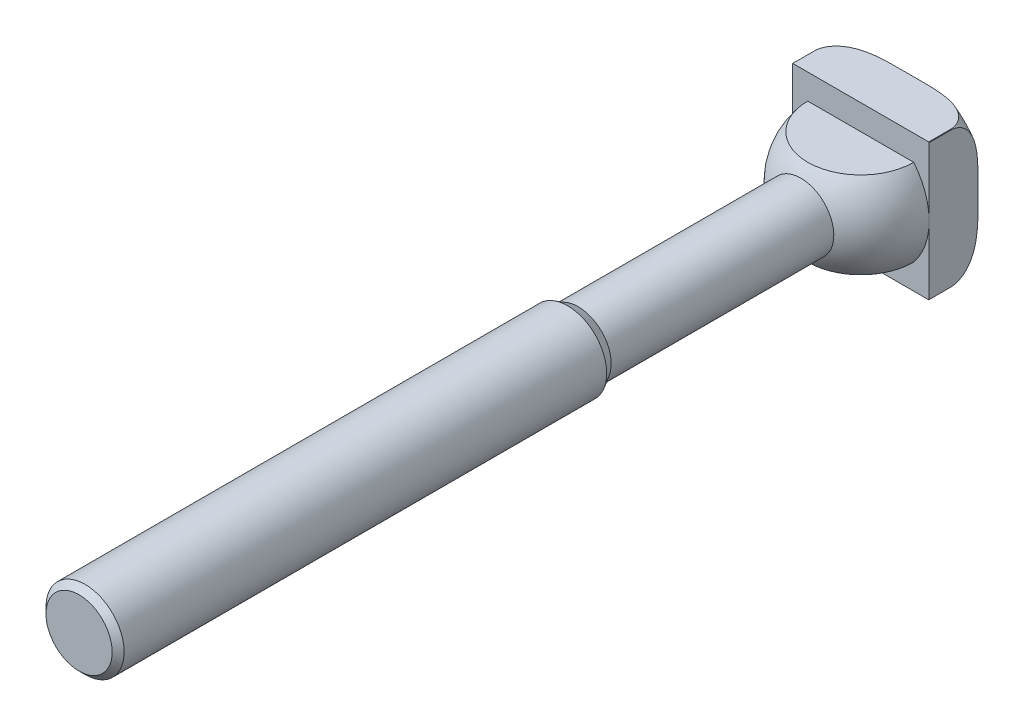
ISO-10303-21;
HEADER;
FILE_DESCRIPTION(('STEP AP214'),'2;1');
FILE_NAME('part.step','',(''),(''),'','','');
FILE_SCHEMA(('AUTOMOTIVE_DESIGN { 1 0 10303 214 1 1 1 1 }'));
ENDSEC;
DATA;
#1=APPLICATION_CONTEXT('core data for automotive mechanical design processes');
#2=APPLICATION_PROTOCOL_DEFINITION('international standard','automotive_design',2000,#1);
#3=PRODUCT_CONTEXT('',#1,'mechanical');
#4=PRODUCT('Part','Part','',(#3));
#5=PRODUCT_RELATED_PRODUCT_CATEGORY('part','',(#4));
#6=PRODUCT_DEFINITION_FORMATION('','',#4);
#7=PRODUCT_DEFINITION_CONTEXT('part definition',#1,'design');
#8=PRODUCT_DEFINITION('design','',#6,#7);
#9=PRODUCT_DEFINITION_SHAPE('','',#8);
#10=(LENGTH_UNIT() NAMED_UNIT(*) SI_UNIT(.MILLI.,.METRE.));
#11=(NAMED_UNIT(*) PLANE_ANGLE_UNIT() SI_UNIT($,.RADIAN.));
#12=(NAMED_UNIT(*) SI_UNIT($,.STERADIAN.) SOLID_ANGLE_UNIT());
#13=UNCERTAINTY_MEASURE_WITH_UNIT(LENGTH_MEASURE(1.E-05),#10,'distance_accuracy_value','');
#14=(GEOMETRIC_REPRESENTATION_CONTEXT(3) GLOBAL_UNCERTAINTY_ASSIGNED_CONTEXT((#13)) GLOBAL_UNIT_ASSIGNED_CONTEXT((#10,
#11,#12)) REPRESENTATION_CONTEXT('',''));
#15=CARTESIAN_POINT('',(0.,0.,0.));
#16=DIRECTION('',(0.,0.,1.));
#17=DIRECTION('',(1.,0.,0.));
#18=AXIS2_PLACEMENT_3D('',#15,#16,#17);
#19=CARTESIAN_POINT('',(0.,0.,-4.40000000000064));
#20=DIRECTION('',(0.,0.,-1.));
#21=DIRECTION('',(0.,-1.,0.));
#22=AXIS2_PLACEMENT_3D('',#19,#20,#21);
#23=TOROIDAL_SURFACE('',#22,14.1400000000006,5.59999999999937);
#24=CARTESIAN_POINT('',(-14.,0.,-9.99824972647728));
#25=CARTESIAN_POINT('',(-14.,-0.310759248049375,-9.99825085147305));
#26=CARTESIAN_POINT('',(-14.,-0.621518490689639,-9.99853784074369));
#27=CARTESIAN_POINT('',(-14.,-1.24303661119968,-9.99934060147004));
#28=CARTESIAN_POINT('',(-14.,-1.55379548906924,-9.99985637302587));
#29=CARTESIAN_POINT('',(-14.,-2.17555675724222,-10.0000957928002));
#30=CARTESIAN_POINT('',(-14.,-2.4865591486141,-9.99981882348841));
#31=CARTESIAN_POINT('',(-14.,-3.10856376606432,-9.9968399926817));
#32=CARTESIAN_POINT('',(-14.,-3.41956599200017,-9.99413807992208));
#33=CARTESIAN_POINT('',(-14.,-4.04142447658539,-9.98415314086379));
#34=CARTESIAN_POINT('',(-14.,-4.35228075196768,-9.97687135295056));
#35=CARTESIAN_POINT('',(-14.,-4.97375164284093,-9.95513103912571));
#36=CARTESIAN_POINT('',(-14.,-5.28436626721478,-9.94067279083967));
#37=CARTESIAN_POINT('',(-14.,-5.90457312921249,-9.90163480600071));
#38=CARTESIAN_POINT('',(-14.,-6.21416618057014,-9.87706873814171));
#39=CARTESIAN_POINT('',(-14.,-6.83210242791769,-9.81452432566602));
#40=CARTESIAN_POINT('',(-14.,-7.14044538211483,-9.77654350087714));
#41=CARTESIAN_POINT('',(-14.,-7.7603772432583,-9.68271738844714));
#42=CARTESIAN_POINT('',(-14.,-8.07191904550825,-9.62655135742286));
#43=CARTESIAN_POINT('',(-14.,-8.6902315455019,-9.49254678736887));
#44=CARTESIAN_POINT('',(-14.,-8.99700487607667,-9.41472069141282));
#45=CARTESIAN_POINT('',(-14.,-9.60149117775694,-9.23352582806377));
#46=CARTESIAN_POINT('',(-14.,-9.89923995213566,-9.13027881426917));
#47=CARTESIAN_POINT('',(-14.,-10.4824504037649,-8.89388231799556));
#48=CARTESIAN_POINT('',(-14.,-10.7679262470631,-8.76076847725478));
#49=CARTESIAN_POINT('',(-14.,-11.3136573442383,-8.46441782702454));
#50=CARTESIAN_POINT('',(-14.,-11.5743689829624,-8.30203188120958));
#51=CARTESIAN_POINT('',(-14.,-12.0709995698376,-7.94177662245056));
#52=CARTESIAN_POINT('',(-14.,-12.3068984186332,-7.74387888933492));
#53=CARTESIAN_POINT('',(-14.,-12.6351816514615,-7.41887852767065));
#54=CARTESIAN_POINT('',(-14.,-12.7408989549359,-7.30509090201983));
#55=CARTESIAN_POINT('',(-14.,-12.941686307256,-7.06851889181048));
#56=CARTESIAN_POINT('',(-14.,-13.0367621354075,-6.94573945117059));
#57=CARTESIAN_POINT('',(-14.,-13.2145748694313,-6.69177024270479));
#58=CARTESIAN_POINT('',(-14.,-13.2973291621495,-6.56059270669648));
#59=CARTESIAN_POINT('',(-14.,-13.449016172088,-6.29054624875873));
#60=CARTESIAN_POINT('',(-14.,-13.5179540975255,-6.15168025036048));
#61=CARTESIAN_POINT('',(-14.,-13.6697783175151,-5.79932831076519));
#62=CARTESIAN_POINT('',(-14.,-13.7436357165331,-5.5818412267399));
#63=CARTESIAN_POINT('',(-14.,-13.8537149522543,-5.1376226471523));
#64=CARTESIAN_POINT('',(-14.,-13.8899558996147,-4.91089590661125));
#65=CARTESIAN_POINT('',(-14.,-13.9227119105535,-4.45413617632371));
#66=CARTESIAN_POINT('',(-14.,-13.919155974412,-4.22409800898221));
#67=CARTESIAN_POINT('',(-14.,-13.8723552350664,-3.76811077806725));
#68=CARTESIAN_POINT('',(-14.,-13.8291052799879,-3.54216224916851));
#69=CARTESIAN_POINT('',(-14.,-13.7070151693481,-3.10597064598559));
#70=CARTESIAN_POINT('',(-14.,-13.6290387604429,-2.8954828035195));
#71=CARTESIAN_POINT('',(-14.,-13.4418093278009,-2.48903531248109));
#72=CARTESIAN_POINT('',(-14.,-13.3325526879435,-2.29307734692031));
#73=CARTESIAN_POINT('',(-14.,-13.0760306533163,-1.90105488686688));
#74=CARTESIAN_POINT('',(-14.,-12.9261604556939,-1.70670634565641));
#75=CARTESIAN_POINT('',(-14.,-12.6009114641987,-1.34062905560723));
#76=CARTESIAN_POINT('',(-14.,-12.4255104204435,-1.16892028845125));
#77=CARTESIAN_POINT('',(-14.,-12.0933369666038,-0.881603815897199));
#78=CARTESIAN_POINT('',(-14.,-11.940194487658,-0.761732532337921));
#79=CARTESIAN_POINT('',(-14.,-11.6238593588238,-0.535952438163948));
#80=CARTESIAN_POINT('',(-14.,-11.4606616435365,-0.430050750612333));
#81=CARTESIAN_POINT('',(-14.,-11.1262197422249,-0.231514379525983));
#82=CARTESIAN_POINT('',(-14.,-10.9549677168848,-0.138892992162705));
#83=CARTESIAN_POINT('',(-14.,-10.6063402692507,0.0338060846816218));
#84=CARTESIAN_POINT('',(-14.,-10.4289659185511,0.113885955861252));
#85=CARTESIAN_POINT('',(-14.,-9.95291874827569,0.310667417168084));
#86=CARTESIAN_POINT('',(-14.,-9.65013791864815,0.417465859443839));
#87=CARTESIAN_POINT('',(-14.,-9.0363810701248,0.604202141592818));
#88=CARTESIAN_POINT('',(-14.,-8.72539881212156,0.684118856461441));
#89=CARTESIAN_POINT('',(-14.,-8.09734857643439,0.82177392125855));
#90=CARTESIAN_POINT('',(-14.,-7.78026113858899,0.879421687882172));
#91=CARTESIAN_POINT('',(-14.,-7.14352292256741,0.976351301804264));
#92=CARTESIAN_POINT('',(-14.,-6.82387330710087,1.01564104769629));
#93=CARTESIAN_POINT('',(-14.,-6.08602362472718,1.08964790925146));
#94=CARTESIAN_POINT('',(-14.,-5.66733893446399,1.11936358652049));
#95=CARTESIAN_POINT('',(-14.,-4.82908628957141,1.16245287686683));
#96=CARTESIAN_POINT('',(-14.,-4.40951805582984,1.1758201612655));
#97=CARTESIAN_POINT('',(-14.,-3.56968565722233,1.1930302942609));
#98=CARTESIAN_POINT('',(-14.,-3.14942129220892,1.19686084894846));
#99=CARTESIAN_POINT('',(-14.,-2.30895829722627,1.20041358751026));
#100=CARTESIAN_POINT('',(-14.,-1.88875966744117,1.20013642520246));
#101=CARTESIAN_POINT('',(-14.,-1.04864396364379,1.1991509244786));
#102=CARTESIAN_POINT('',(-14.,-0.628726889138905,1.19844287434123));
#103=CARTESIAN_POINT('',(-14.,0.211127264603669,1.19813401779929));
#104=CARTESIAN_POINT('',(-14.,0.631064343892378,1.1985332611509));
#105=CARTESIAN_POINT('',(-14.,1.4706821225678,1.19965885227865));
#106=CARTESIAN_POINT('',(-14.,1.89036282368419,1.20038500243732));
#107=CARTESIAN_POINT('',(-14.,2.72971643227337,1.19918094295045));
#108=CARTESIAN_POINT('',(-14.,3.14938933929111,1.19725084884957));
#109=CARTESIAN_POINT('',(-14.,3.72184106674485,1.18945550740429));
#110=CARTESIAN_POINT('',(-14.,3.87466005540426,1.18687249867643));
#111=CARTESIAN_POINT('',(-14.,4.18027065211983,1.18040049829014));
#112=CARTESIAN_POINT('',(-14.,4.33306226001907,1.17651149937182));
#113=CARTESIAN_POINT('',(-14.,4.79139482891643,1.16242966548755));
#114=CARTESIAN_POINT('',(-14.,5.09687074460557,1.14982221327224));
#115=CARTESIAN_POINT('',(-14.,5.70773033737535,1.11539646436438));
#116=CARTESIAN_POINT('',(-14.,6.01311337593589,1.09356619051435));
#117=CARTESIAN_POINT('',(-14.,6.62278129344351,1.03760824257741));
#118=CARTESIAN_POINT('',(-14.,6.92706622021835,1.00348111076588));
#119=CARTESIAN_POINT('',(-14.,7.53756680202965,0.919002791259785));
#120=CARTESIAN_POINT('',(-14.,7.84375430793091,0.868441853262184));
#121=CARTESIAN_POINT('',(-14.,8.45235679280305,0.747440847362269));
#122=CARTESIAN_POINT('',(-14.,8.75477072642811,0.676995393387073));
#123=CARTESIAN_POINT('',(-14.,9.35221826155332,0.512485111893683));
#124=CARTESIAN_POINT('',(-14.,9.64727195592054,0.418494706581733));
#125=CARTESIAN_POINT('',(-14.,10.2269376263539,0.202797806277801));
#126=CARTESIAN_POINT('',(-14.,10.5115593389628,0.0811179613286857));
#127=CARTESIAN_POINT('',(-14.,11.0732457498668,-0.197865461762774));
#128=CARTESIAN_POINT('',(-14.,11.3498592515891,-0.356091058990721));
#129=CARTESIAN_POINT('',(-14.,11.8788610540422,-0.709917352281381));
#130=CARTESIAN_POINT('',(-14.,12.1312420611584,-0.905529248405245));
#131=CARTESIAN_POINT('',(-14.,12.484569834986,-1.22925474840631));
#132=CARTESIAN_POINT('',(-14.,12.5987850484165,-1.34304039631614));
#133=CARTESIAN_POINT('',(-14.,12.8164661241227,-1.58042428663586));
#134=CARTESIAN_POINT('',(-14.,12.9199380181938,-1.70401695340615));
#135=CARTESIAN_POINT('',(-14.,13.1142800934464,-1.96051354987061));
#136=CARTESIAN_POINT('',(-14.,13.2051678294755,-2.09340411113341));
#137=CARTESIAN_POINT('',(-14.,13.3726645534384,-2.36782024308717));
#138=CARTESIAN_POINT('',(-14.,13.4492796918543,-2.50934205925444));
#139=CARTESIAN_POINT('',(-14.,13.616341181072,-2.8631997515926));
#140=CARTESIAN_POINT('',(-14.,13.6983634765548,-3.07961651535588));
#141=CARTESIAN_POINT('',(-14.,13.8249239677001,-3.52306568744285));
#142=CARTESIAN_POINT('',(-14.,13.8694841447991,-3.75009178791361));
#143=CARTESIAN_POINT('',(-14.,13.9185610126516,-4.20903331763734));
#144=CARTESIAN_POINT('',(-14.,13.92298355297,-4.44095896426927));
#145=CARTESIAN_POINT('',(-14.,13.8912351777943,-4.90200336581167));
#146=CARTESIAN_POINT('',(-14.,13.8550611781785,-5.13112190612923));
#147=CARTESIAN_POINT('',(-14.,13.7462858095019,-5.57215944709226));
#148=CARTESIAN_POINT('',(-14.,13.6749635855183,-5.78439832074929));
#149=CARTESIAN_POINT('',(-14.,13.5003447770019,-6.19518406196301));
#150=CARTESIAN_POINT('',(-14.,13.3970432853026,-6.39372882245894));
#151=CARTESIAN_POINT('',(-14.,13.1534590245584,-6.78957755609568));
#152=CARTESIAN_POINT('',(-14.,13.0108272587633,-6.98542587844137));
#153=CARTESIAN_POINT('',(-14.,12.699599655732,-7.35524295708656));
#154=CARTESIAN_POINT('',(-14.,12.5309874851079,-7.52919782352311));
#155=CARTESIAN_POINT('',(-14.,12.2128466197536,-7.81886907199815));
#156=CARTESIAN_POINT('',(-14.,12.0672621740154,-7.93898454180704));
#157=CARTESIAN_POINT('',(-14.,11.7660321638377,-8.16591189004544));
#158=CARTESIAN_POINT('',(-14.,11.6103820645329,-8.27271770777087));
#159=CARTESIAN_POINT('',(-14.,11.1309674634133,-8.57419374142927));
#160=CARTESIAN_POINT('',(-14.,10.7950194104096,-8.74967609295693));
#161=CARTESIAN_POINT('',(-14.,10.1706537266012,-9.02589055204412));
#162=CARTESIAN_POINT('',(-14.,9.88556746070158,-9.13451214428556));
#163=CARTESIAN_POINT('',(-14.,9.30681398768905,-9.3264233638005));
#164=CARTESIAN_POINT('',(-14.,9.0131406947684,-9.40969452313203));
#165=CARTESIAN_POINT('',(-14.,8.42011381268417,-9.55475710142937));
#166=CARTESIAN_POINT('',(-14.,8.12075104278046,-9.61651002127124));
#167=CARTESIAN_POINT('',(-14.,7.51883351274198,-9.72211873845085));
#168=CARTESIAN_POINT('',(-14.,7.21627753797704,-9.76596745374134));
#169=CARTESIAN_POINT('',(-14.,6.62682275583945,-9.83715592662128));
#170=CARTESIAN_POINT('',(-14.,6.34001723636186,-9.86529590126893));
#171=CARTESIAN_POINT('',(-14.,5.76566600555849,-9.91149411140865));
#172=CARTESIAN_POINT('',(-14.,5.47812040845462,-9.92955381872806));
#173=CARTESIAN_POINT('',(-14.,4.90241848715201,-9.95811498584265));
#174=CARTESIAN_POINT('',(-14.,4.61426184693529,-9.96860968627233));
#175=CARTESIAN_POINT('',(-14.,4.03780736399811,-9.98427067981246));
#176=CARTESIAN_POINT('',(-14.,3.74950951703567,-9.98943680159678));
#177=CARTESIAN_POINT('',(-14.,3.17268829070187,-9.99640544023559));
#178=CARTESIAN_POINT('',(-14.,2.884164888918,-9.99820571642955));
#179=CARTESIAN_POINT('',(-14.,2.30711989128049,-10.0000585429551));
#180=CARTESIAN_POINT('',(-14.,2.01859829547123,-10.0001111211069));
#181=CARTESIAN_POINT('',(-14.,1.44173081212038,-9.99968852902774));
#182=CARTESIAN_POINT('',(-14.,1.15338492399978,-9.99921367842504));
#183=CARTESIAN_POINT('',(-14.,0.576692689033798,-9.99849375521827));
#184=CARTESIAN_POINT('',(-14.,0.288346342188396,-9.99824868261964));
#185=CARTESIAN_POINT('',(-14.,0.,-9.99824972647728));
#186=B_SPLINE_CURVE_WITH_KNOTS('',3,(#24,#25,#26,#27,#28,#29,#30,#31,#32,#33,#34,#35,#36,#37,
#38,#39,#40,#41,#42,#43,#44,#45,#46,#47,#48,#49,#50,#51,#52,#53,#54,#55,#56,#57,#58,#59,#60,#61,
#62,#63,#64,#65,#66,#67,#68,#69,#70,#71,#72,#73,#74,#75,#76,#77,#78,#79,#80,#81,#82,#83,#84,#85,
#86,#87,#88,#89,#90,#91,#92,#93,#94,#95,#96,#97,#98,#99,#100,#101,#102,#103,#104,#105,#106,#107,
#108,#109,#110,#111,#112,#113,#114,#115,#116,#117,#118,#119,#120,#121,#122,#123,#124,#125,#126,
#127,#128,#129,#130,#131,#132,#133,#134,#135,#136,#137,#138,#139,#140,#141,#142,#143,#144,#145,
#146,#147,#148,#149,#150,#151,#152,#153,#154,#155,#156,#157,#158,#159,#160,#161,#162,#163,#164,
#165,#166,#167,#168,#169,#170,#171,#172,#173,#174,#175,#176,#177,#178,#179,#180,#181,#182,#183,
#184,#185),.UNSPECIFIED.,.T.,.F.,(4,2,2,2,2,2,2,2,2,2,2,2,2,2,2,2,2,2,2,2,2,2,2,2,2,2,2,2,2,2,2,
2,2,2,2,2,2,2,2,2,2,2,2,2,2,2,2,2,2,2,2,2,2,2,2,2,2,2,2,2,2,2,2,2,2,2,2,2,2,2,2,2,2,2,2,2,2,2,2,
2,4),(0.,0.932277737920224,1.864555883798,2.79756045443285,3.73058474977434,4.66335686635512,
5.59609290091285,6.52757173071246,7.45922286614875,8.40829357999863,9.35682020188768,
10.3008893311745,11.2438377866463,12.162838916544,13.0825788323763,13.5480143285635,
14.0131958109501,14.4777145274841,14.942057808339,15.6278649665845,16.3133235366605,
17.0000051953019,17.6867759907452,18.3573439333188,19.0279894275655,19.7615747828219,
20.495803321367,21.0784512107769,21.6613950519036,22.2449185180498,22.8283403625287,
23.7898904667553,24.7521944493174,25.7183725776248,26.6841346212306,27.9428211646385,
29.2019948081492,30.462790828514,31.7233861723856,32.9831390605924,34.2429485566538,
35.5019975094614,36.7609916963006,37.2195087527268,37.6780283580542,38.5951359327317,
39.5134381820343,40.4316999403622,41.3621750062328,42.2929023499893,43.2207241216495,
44.1476566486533,45.1011871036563,46.0550036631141,46.5381223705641,47.0209683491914,
47.5031338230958,47.9850910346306,48.6761799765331,49.3668631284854,50.0591659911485,
50.7515214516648,51.4203582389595,52.0892977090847,52.813462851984,53.5380851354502,
54.103530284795,54.669231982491,55.8017422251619,56.7158020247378,57.630526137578,
58.5468785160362,59.4635930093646,60.3279216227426,61.1921240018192,62.0570975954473,
62.9220989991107,63.7876760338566,64.6532392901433,65.5182782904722,66.3833173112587),.UNSPECIFIED.);
#187=CARTESIAN_POINT('',(-14.,-1.98484256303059,-10.));
#188=VERTEX_POINT('',#187);
#189=CARTESIAN_POINT('',(-14.,-13.916450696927,-4.4));
#190=VERTEX_POINT('',#189);
#191=EDGE_CURVE('E264',#188,#190,#186,.T.);
#192=ORIENTED_EDGE('',*,*,#191,.F.);
#193=CARTESIAN_POINT('',(0.,0.,-10.));
#194=DIRECTION('',(0.,0.,-1.));
#195=DIRECTION('',(0.,-1.,0.));
#196=AXIS2_PLACEMENT_3D('',#193,#194,#195);
#197=CIRCLE('',#196,14.14);
#198=CARTESIAN_POINT('',(-1.98484256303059,-14.,-10.));
#199=VERTEX_POINT('',#198);
#200=EDGE_CURVE('E267',#199,#188,#197,.T.);
#201=ORIENTED_EDGE('',*,*,#200,.F.);
#202=CARTESIAN_POINT('',(0.,-14.,-9.99824972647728));
#203=CARTESIAN_POINT('',(0.310759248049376,-14.,-9.99825085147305));
#204=CARTESIAN_POINT('',(0.621518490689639,-14.,-9.99853784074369));
#205=CARTESIAN_POINT('',(1.24303661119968,-14.,-9.99934060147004));
#206=CARTESIAN_POINT('',(1.55379548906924,-14.,-9.99985637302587));
#207=CARTESIAN_POINT('',(2.17555675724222,-14.,-10.0000957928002));
#208=CARTESIAN_POINT('',(2.4865591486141,-14.,-9.99981882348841));
#209=CARTESIAN_POINT('',(3.10856376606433,-14.,-9.9968399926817));
#210=CARTESIAN_POINT('',(3.41956599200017,-14.,-9.99413807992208));
#211=CARTESIAN_POINT('',(4.04142447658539,-14.,-9.98415314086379));
#212=CARTESIAN_POINT('',(4.35228075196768,-14.,-9.97687135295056));
#213=CARTESIAN_POINT('',(4.97375164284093,-14.,-9.95513103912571));
#214=CARTESIAN_POINT('',(5.28436626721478,-14.,-9.94067279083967));
#215=CARTESIAN_POINT('',(5.90457312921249,-14.,-9.90163480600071));
#216=CARTESIAN_POINT('',(6.21416618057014,-14.,-9.87706873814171));
#217=CARTESIAN_POINT('',(6.83210242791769,-14.,-9.81452432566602));
#218=CARTESIAN_POINT('',(7.14044538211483,-14.,-9.77654350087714));
#219=CARTESIAN_POINT('',(7.7603772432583,-14.,-9.68271738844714));
#220=CARTESIAN_POINT('',(8.07191904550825,-14.,-9.62655135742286));
#221=CARTESIAN_POINT('',(8.6902315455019,-14.,-9.49254678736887));
#222=CARTESIAN_POINT('',(8.99700487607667,-14.,-9.41472069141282));
#223=CARTESIAN_POINT('',(9.60149117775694,-14.,-9.23352582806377));
#224=CARTESIAN_POINT('',(9.89923995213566,-14.,-9.13027881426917));
#225=CARTESIAN_POINT('',(10.4824504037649,-14.,-8.89388231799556));
#226=CARTESIAN_POINT('',(10.7679262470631,-14.,-8.76076847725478));
#227=CARTESIAN_POINT('',(11.3136573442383,-14.,-8.46441782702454));
#228=CARTESIAN_POINT('',(11.5743689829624,-14.,-8.30203188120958));
#229=CARTESIAN_POINT('',(12.0709995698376,-14.,-7.94177662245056));
#230=CARTESIAN_POINT('',(12.3068984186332,-14.,-7.74387888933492));
#231=CARTESIAN_POINT('',(12.6351816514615,-14.,-7.41887852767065));
#232=CARTESIAN_POINT('',(12.7408989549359,-14.,-7.30509090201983));
#233=CARTESIAN_POINT('',(12.941686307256,-14.,-7.06851889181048));
#234=CARTESIAN_POINT('',(13.0367621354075,-14.,-6.94573945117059));
#235=CARTESIAN_POINT('',(13.2145748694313,-14.,-6.69177024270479));
#236=CARTESIAN_POINT('',(13.2973291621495,-14.,-6.56059270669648));
#237=CARTESIAN_POINT('',(13.449016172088,-14.,-6.29054624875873));
#238=CARTESIAN_POINT('',(13.5179540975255,-14.,-6.15168025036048));
#239=CARTESIAN_POINT('',(13.6697783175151,-14.,-5.79932831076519));
#240=CARTESIAN_POINT('',(13.7436357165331,-14.,-5.5818412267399));
#241=CARTESIAN_POINT('',(13.8537149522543,-14.,-5.1376226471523));
#242=CARTESIAN_POINT('',(13.8899558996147,-14.,-4.91089590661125));
#243=CARTESIAN_POINT('',(13.9227119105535,-14.,-4.45413617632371));
#244=CARTESIAN_POINT('',(13.919155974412,-14.,-4.22409800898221));
#245=CARTESIAN_POINT('',(13.8723552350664,-14.,-3.76811077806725));
#246=CARTESIAN_POINT('',(13.8291052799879,-14.,-3.54216224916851));
#247=CARTESIAN_POINT('',(13.7070151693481,-14.,-3.10597064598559));
#248=CARTESIAN_POINT('',(13.6290387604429,-14.,-2.8954828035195));
#249=CARTESIAN_POINT('',(13.4418093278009,-14.,-2.48903531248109));
#250=CARTESIAN_POINT('',(13.3325526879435,-14.,-2.29307734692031));
#251=CARTESIAN_POINT('',(13.0760306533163,-14.,-1.90105488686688));
#252=CARTESIAN_POINT('',(12.9261604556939,-14.,-1.70670634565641));
#253=CARTESIAN_POINT('',(12.6009114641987,-14.,-1.34062905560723));
#254=CARTESIAN_POINT('',(12.4255104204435,-14.,-1.16892028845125));
#255=CARTESIAN_POINT('',(12.0933369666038,-14.,-0.881603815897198));
#256=CARTESIAN_POINT('',(11.940194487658,-14.,-0.761732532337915));
#257=CARTESIAN_POINT('',(11.6238593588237,-14.,-0.535952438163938));
#258=CARTESIAN_POINT('',(11.4606616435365,-14.,-0.430050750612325));
#259=CARTESIAN_POINT('',(11.1262197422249,-14.,-0.231514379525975));
#260=CARTESIAN_POINT('',(10.9549677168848,-14.,-0.138892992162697));
#261=CARTESIAN_POINT('',(10.6063402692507,-14.,0.0338060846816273));
#262=CARTESIAN_POINT('',(10.4289659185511,-14.,0.113885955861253));
#263=CARTESIAN_POINT('',(9.95291874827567,-14.,0.310667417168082));
#264=CARTESIAN_POINT('',(9.65013791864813,-14.,0.417465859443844));
#265=CARTESIAN_POINT('',(9.03638107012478,-14.,0.604202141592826));
#266=CARTESIAN_POINT('',(8.72539881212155,-14.,0.684118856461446));
#267=CARTESIAN_POINT('',(8.09734857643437,-14.,0.821773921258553));
#268=CARTESIAN_POINT('',(7.78026113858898,-14.,0.879421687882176));
#269=CARTESIAN_POINT('',(7.1435229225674,-14.,0.976351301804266));
#270=CARTESIAN_POINT('',(6.82387330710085,-14.,1.01564104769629));
#271=CARTESIAN_POINT('',(6.08602362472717,-14.,1.08964790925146));
#272=CARTESIAN_POINT('',(5.66733893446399,-14.,1.11936358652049));
#273=CARTESIAN_POINT('',(4.82908628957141,-14.,1.16245287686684));
#274=CARTESIAN_POINT('',(4.40951805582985,-14.,1.1758201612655));
#275=CARTESIAN_POINT('',(3.56968565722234,-14.,1.1930302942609));
#276=CARTESIAN_POINT('',(3.14942129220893,-14.,1.19686084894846));
#277=CARTESIAN_POINT('',(2.30895829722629,-14.,1.20041358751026));
#278=CARTESIAN_POINT('',(1.8887596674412,-14.,1.20013642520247));
#279=CARTESIAN_POINT('',(1.04864396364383,-14.,1.1991509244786));
#280=CARTESIAN_POINT('',(0.628726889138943,-14.,1.19844287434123));
#281=CARTESIAN_POINT('',(-0.211127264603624,-14.,1.19813401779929));
#282=CARTESIAN_POINT('',(-0.631064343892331,-14.,1.1985332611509));
#283=CARTESIAN_POINT('',(-1.47068212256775,-14.,1.19965885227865));
#284=CARTESIAN_POINT('',(-1.89036282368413,-14.,1.20038500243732));
#285=CARTESIAN_POINT('',(-2.7297164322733,-14.,1.19918094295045));
#286=CARTESIAN_POINT('',(-3.14938933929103,-14.,1.19725084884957));
#287=CARTESIAN_POINT('',(-3.72184106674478,-14.,1.18945550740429));
#288=CARTESIAN_POINT('',(-3.87466005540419,-14.,1.18687249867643));
#289=CARTESIAN_POINT('',(-4.18027065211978,-14.,1.18040049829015));
#290=CARTESIAN_POINT('',(-4.33306226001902,-14.,1.17651149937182));
#291=CARTESIAN_POINT('',(-4.79139482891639,-14.,1.16242966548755));
#292=CARTESIAN_POINT('',(-5.09687074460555,-14.,1.14982221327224));
#293=CARTESIAN_POINT('',(-5.70773033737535,-14.,1.11539646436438));
#294=CARTESIAN_POINT('',(-6.01311337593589,-14.,1.09356619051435));
#295=CARTESIAN_POINT('',(-6.62278129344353,-14.,1.03760824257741));
#296=CARTESIAN_POINT('',(-6.92706622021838,-14.,1.00348111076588));
#297=CARTESIAN_POINT('',(-7.5375668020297,-14.,0.919002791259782));
#298=CARTESIAN_POINT('',(-7.84375430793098,-14.,0.868441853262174));
#299=CARTESIAN_POINT('',(-8.45235679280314,-14.,0.747440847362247));
#300=CARTESIAN_POINT('',(-8.7547707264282,-14.,0.676995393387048));
#301=CARTESIAN_POINT('',(-9.35221826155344,-14.,0.512485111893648));
#302=CARTESIAN_POINT('',(-9.64727195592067,-14.,0.41849470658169));
#303=CARTESIAN_POINT('',(-10.2269376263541,-14.,0.202797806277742));
#304=CARTESIAN_POINT('',(-10.511559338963,-14.,0.081117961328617));
#305=CARTESIAN_POINT('',(-11.0732457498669,-14.,-0.197865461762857));
#306=CARTESIAN_POINT('',(-11.3498592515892,-14.,-0.356091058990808));
#307=CARTESIAN_POINT('',(-11.8788610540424,-14.,-0.709917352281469));
#308=CARTESIAN_POINT('',(-12.1312420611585,-14.,-0.905529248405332));
#309=CARTESIAN_POINT('',(-12.4845698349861,-14.,-1.2292547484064));
#310=CARTESIAN_POINT('',(-12.5987850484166,-14.,-1.34304039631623));
#311=CARTESIAN_POINT('',(-12.8164661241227,-14.,-1.58042428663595));
#312=CARTESIAN_POINT('',(-12.9199380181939,-14.,-1.70401695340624));
#313=CARTESIAN_POINT('',(-13.1142800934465,-14.,-1.9605135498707));
#314=CARTESIAN_POINT('',(-13.2051678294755,-14.,-2.0934041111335));
#315=CARTESIAN_POINT('',(-13.3726645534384,-14.,-2.36782024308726));
#316=CARTESIAN_POINT('',(-13.4492796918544,-14.,-2.50934205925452));
#317=CARTESIAN_POINT('',(-13.6163411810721,-14.,-2.86319975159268));
#318=CARTESIAN_POINT('',(-13.6983634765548,-14.,-3.07961651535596));
#319=CARTESIAN_POINT('',(-13.8249239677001,-14.,-3.52306568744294));
#320=CARTESIAN_POINT('',(-13.8694841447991,-14.,-3.7500917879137));
#321=CARTESIAN_POINT('',(-13.9185610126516,-14.,-4.20903331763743));
#322=CARTESIAN_POINT('',(-13.92298355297,-14.,-4.44095896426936));
#323=CARTESIAN_POINT('',(-13.8912351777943,-14.,-4.90200336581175));
#324=CARTESIAN_POINT('',(-13.8550611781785,-14.,-5.13112190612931));
#325=CARTESIAN_POINT('',(-13.7462858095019,-14.,-5.57215944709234));
#326=CARTESIAN_POINT('',(-13.6749635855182,-14.,-5.78439832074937));
#327=CARTESIAN_POINT('',(-13.5003447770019,-14.,-6.19518406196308));
#328=CARTESIAN_POINT('',(-13.3970432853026,-14.,-6.39372882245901));
#329=CARTESIAN_POINT('',(-13.1534590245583,-14.,-6.78957755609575));
#330=CARTESIAN_POINT('',(-13.0108272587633,-14.,-6.98542587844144));
#331=CARTESIAN_POINT('',(-12.6995996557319,-14.,-7.35524295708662));
#332=CARTESIAN_POINT('',(-12.5309874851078,-14.,-7.52919782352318));
#333=CARTESIAN_POINT('',(-12.2128466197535,-14.,-7.81886907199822));
#334=CARTESIAN_POINT('',(-12.0672621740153,-14.,-7.93898454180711));
#335=CARTESIAN_POINT('',(-11.7660321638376,-14.,-8.16591189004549));
#336=CARTESIAN_POINT('',(-11.6103820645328,-14.,-8.27271770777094));
#337=CARTESIAN_POINT('',(-11.1309674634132,-14.,-8.57419374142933));
#338=CARTESIAN_POINT('',(-10.7950194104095,-14.,-8.74967609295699));
#339=CARTESIAN_POINT('',(-10.170653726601,-14.,-9.02589055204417));
#340=CARTESIAN_POINT('',(-9.88556746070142,-14.,-9.13451214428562));
#341=CARTESIAN_POINT('',(-9.30681398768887,-14.,-9.32642336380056));
#342=CARTESIAN_POINT('',(-9.01314069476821,-14.,-9.40969452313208));
#343=CARTESIAN_POINT('',(-8.42011381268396,-14.,-9.55475710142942));
#344=CARTESIAN_POINT('',(-8.12075104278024,-14.,-9.61651002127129));
#345=CARTESIAN_POINT('',(-7.51883351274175,-14.,-9.72211873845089));
#346=CARTESIAN_POINT('',(-7.2162775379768,-14.,-9.76596745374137));
#347=CARTESIAN_POINT('',(-6.6268227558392,-14.,-9.8371559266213));
#348=CARTESIAN_POINT('',(-6.34001723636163,-14.,-9.86529590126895));
#349=CARTESIAN_POINT('',(-5.76566600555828,-14.,-9.91149411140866));
#350=CARTESIAN_POINT('',(-5.47812040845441,-14.,-9.92955381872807));
#351=CARTESIAN_POINT('',(-4.90241848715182,-14.,-9.95811498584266));
#352=CARTESIAN_POINT('',(-4.61426184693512,-14.,-9.96860968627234));
#353=CARTESIAN_POINT('',(-4.03780736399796,-14.,-9.98427067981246));
#354=CARTESIAN_POINT('',(-3.74950951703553,-14.,-9.98943680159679));
#355=CARTESIAN_POINT('',(-3.17268829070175,-14.,-9.99640544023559));
#356=CARTESIAN_POINT('',(-2.88416488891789,-14.,-9.99820571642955));
#357=CARTESIAN_POINT('',(-2.3071198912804,-14.,-10.0000585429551));
#358=CARTESIAN_POINT('',(-2.01859829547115,-14.,-10.0001111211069));
#359=CARTESIAN_POINT('',(-1.44173081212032,-14.,-9.99968852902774));
#360=CARTESIAN_POINT('',(-1.15338492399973,-14.,-9.99921367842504));
#361=CARTESIAN_POINT('',(-0.57669268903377,-14.,-9.99849375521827));
#362=CARTESIAN_POINT('',(-0.288346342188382,-14.,-9.99824868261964));
#363=CARTESIAN_POINT('',(0.,-14.,-9.99824972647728));
#364=B_SPLINE_CURVE_WITH_KNOTS('',3,(#202,#203,#204,#205,#206,#207,#208,#209,#210,#211,#212,
#213,#214,#215,#216,#217,#218,#219,#220,#221,#222,#223,#224,#225,#226,#227,#228,#229,#230,#231,
#232,#233,#234,#235,#236,#237,#238,#239,#240,#241,#242,#243,#244,#245,#246,#247,#248,#249,#250,
#251,#252,#253,#254,#255,#256,#257,#258,#259,#260,#261,#262,#263,#264,#265,#266,#267,#268,#269,
#270,#271,#272,#273,#274,#275,#276,#277,#278,#279,#280,#281,#282,#283,#284,#285,#286,#287,#288,
#289,#290,#291,#292,#293,#294,#295,#296,#297,#298,#299,#300,#301,#302,#303,#304,#305,#306,#307,
#308,#309,#310,#311,#312,#313,#314,#315,#316,#317,#318,#319,#320,#321,#322,#323,#324,#325,#326,
#327,#328,#329,#330,#331,#332,#333,#334,#335,#336,#337,#338,#339,#340,#341,#342,#343,#344,#345,
#346,#347,#348,#349,#350,#351,#352,#353,#354,#355,#356,#357,#358,#359,#360,#361,#362,#363),
.UNSPECIFIED.,.T.,.F.,(4,2,2,2,2,2,2,2,2,2,2,2,2,2,2,2,2,2,2,2,2,2,2,2,2,2,2,2,2,2,2,2,2,2,2,2,
2,2,2,2,2,2,2,2,2,2,2,2,2,2,2,2,2,2,2,2,2,2,2,2,2,2,2,2,2,2,2,2,2,2,2,2,2,2,2,2,2,2,2,2,4),(0.,
0.932277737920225,1.864555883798,2.79756045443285,3.73058474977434,4.66335686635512,
5.59609290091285,6.52757173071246,7.45922286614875,8.40829357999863,9.35682020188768,
10.3008893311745,11.2438377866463,12.162838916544,13.0825788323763,13.5480143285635,
14.0131958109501,14.4777145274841,14.942057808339,15.6278649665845,16.3133235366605,
17.0000051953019,17.6867759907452,18.3573439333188,19.0279894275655,19.7615747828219,
20.4958033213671,21.0784512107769,21.6613950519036,22.2449185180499,22.8283403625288,
23.7898904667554,24.7521944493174,25.7183725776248,26.6841346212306,27.9428211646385,
29.2019948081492,30.462790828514,31.7233861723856,32.9831390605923,34.2429485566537,
35.5019975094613,36.7609916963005,37.2195087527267,37.6780283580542,38.5951359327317,
39.5134381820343,40.4316999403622,41.3621750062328,42.2929023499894,43.2207241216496,
44.1476566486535,45.1011871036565,46.0550036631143,46.5381223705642,47.0209683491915,
47.5031338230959,47.9850910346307,48.6761799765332,49.3668631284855,50.0591659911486,
50.7515214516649,51.4203582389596,52.0892977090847,52.813462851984,53.5380851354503,
54.1035302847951,54.6692319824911,55.801742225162,56.7158020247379,57.6305261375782,
58.5468785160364,59.4635930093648,60.3279216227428,61.1921240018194,62.0570975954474,
62.9220989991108,63.7876760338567,64.6532392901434,65.5182782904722,66.3833173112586),.UNSPECIFIED.);
#365=CARTESIAN_POINT('',(-13.916450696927,-14.,-4.4));
#366=VERTEX_POINT('',#365);
#367=EDGE_CURVE('E310',#366,#199,#364,.T.);
#368=ORIENTED_EDGE('',*,*,#367,.F.);
#369=CARTESIAN_POINT('',(0.,0.,-4.4));
#370=DIRECTION('',(0.,0.,-1.));
#371=DIRECTION('',(0.,-1.,0.));
#372=AXIS2_PLACEMENT_3D('',#369,#370,#371);
#373=CIRCLE('',#372,19.74);
#374=EDGE_CURVE('E167',#366,#190,#373,.T.);
#375=ORIENTED_EDGE('',*,*,#374,.T.);
#376=EDGE_LOOP('',(#192,#201,#368,#375));
#377=FACE_BOUND('',#376,.T.);
#378=ADVANCED_FACE('F14',(#377),#23,.T.);
#379=CARTESIAN_POINT('',(-14.,13.916450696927,-4.4));
#380=VERTEX_POINT('',#379);
#381=CARTESIAN_POINT('',(-14.,1.98484256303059,-10.));
#382=VERTEX_POINT('',#381);
#383=EDGE_CURVE('E271',#380,#382,#186,.T.);
#384=ORIENTED_EDGE('',*,*,#383,.F.);
#385=CARTESIAN_POINT('',(-13.916450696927,14.,-4.4));
#386=VERTEX_POINT('',#385);
#387=EDGE_CURVE('E290',#380,#386,#373,.T.);
#388=ORIENTED_EDGE('',*,*,#387,.T.);
#389=CARTESIAN_POINT('',(0.,14.,-9.99824972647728));
#390=CARTESIAN_POINT('',(-0.310759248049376,14.,-9.99825085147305));
#391=CARTESIAN_POINT('',(-0.621518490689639,14.,-9.99853784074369));
#392=CARTESIAN_POINT('',(-1.24303661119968,14.,-9.99934060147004));
#393=CARTESIAN_POINT('',(-1.55379548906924,14.,-9.99985637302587));
#394=CARTESIAN_POINT('',(-2.17555675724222,14.,-10.0000957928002));
#395=CARTESIAN_POINT('',(-2.4865591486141,14.,-9.99981882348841));
#396=CARTESIAN_POINT('',(-3.10856376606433,14.,-9.9968399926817));
#397=CARTESIAN_POINT('',(-3.41956599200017,14.,-9.99413807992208));
#398=CARTESIAN_POINT('',(-4.04142447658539,14.,-9.98415314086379));
#399=CARTESIAN_POINT('',(-4.35228075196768,14.,-9.97687135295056));
#400=CARTESIAN_POINT('',(-4.97375164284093,14.,-9.95513103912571));
#401=CARTESIAN_POINT('',(-5.28436626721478,14.,-9.94067279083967));
#402=CARTESIAN_POINT('',(-5.90457312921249,14.,-9.90163480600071));
#403=CARTESIAN_POINT('',(-6.21416618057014,14.,-9.87706873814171));
#404=CARTESIAN_POINT('',(-6.83210242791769,14.,-9.81452432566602));
#405=CARTESIAN_POINT('',(-7.14044538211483,14.,-9.77654350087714));
#406=CARTESIAN_POINT('',(-7.7603772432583,14.,-9.68271738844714));
#407=CARTESIAN_POINT('',(-8.07191904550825,14.,-9.62655135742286));
#408=CARTESIAN_POINT('',(-8.6902315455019,14.,-9.49254678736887));
#409=CARTESIAN_POINT('',(-8.99700487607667,14.,-9.41472069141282));
#410=CARTESIAN_POINT('',(-9.60149117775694,14.,-9.23352582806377));
#411=CARTESIAN_POINT('',(-9.89923995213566,14.,-9.13027881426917));
#412=CARTESIAN_POINT('',(-10.4824504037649,14.,-8.89388231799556));
#413=CARTESIAN_POINT('',(-10.7679262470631,14.,-8.76076847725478));
#414=CARTESIAN_POINT('',(-11.3136573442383,14.,-8.46441782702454));
#415=CARTESIAN_POINT('',(-11.5743689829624,14.,-8.30203188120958));
#416=CARTESIAN_POINT('',(-12.0709995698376,14.,-7.94177662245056));
#417=CARTESIAN_POINT('',(-12.3068984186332,14.,-7.74387888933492));
#418=CARTESIAN_POINT('',(-12.6351816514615,14.,-7.41887852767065));
#419=CARTESIAN_POINT('',(-12.7408989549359,14.,-7.30509090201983));
#420=CARTESIAN_POINT('',(-12.941686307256,14.,-7.06851889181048));
#421=CARTESIAN_POINT('',(-13.0367621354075,14.,-6.94573945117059));
#422=CARTESIAN_POINT('',(-13.2145748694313,14.,-6.69177024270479));
#423=CARTESIAN_POINT('',(-13.2973291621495,14.,-6.56059270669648));
#424=CARTESIAN_POINT('',(-13.449016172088,14.,-6.29054624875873));
#425=CARTESIAN_POINT('',(-13.5179540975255,14.,-6.15168025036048));
#426=CARTESIAN_POINT('',(-13.6697783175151,14.,-5.79932831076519));
#427=CARTESIAN_POINT('',(-13.7436357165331,14.,-5.5818412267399));
#428=CARTESIAN_POINT('',(-13.8537149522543,14.,-5.1376226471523));
#429=CARTESIAN_POINT('',(-13.8899558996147,14.,-4.91089590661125));
#430=CARTESIAN_POINT('',(-13.9227119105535,14.,-4.45413617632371));
#431=CARTESIAN_POINT('',(-13.919155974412,14.,-4.22409800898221));
#432=CARTESIAN_POINT('',(-13.8723552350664,14.,-3.76811077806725));
#433=CARTESIAN_POINT('',(-13.8291052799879,14.,-3.54216224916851));
#434=CARTESIAN_POINT('',(-13.7070151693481,14.,-3.10597064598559));
#435=CARTESIAN_POINT('',(-13.6290387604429,14.,-2.8954828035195));
#436=CARTESIAN_POINT('',(-13.4418093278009,14.,-2.48903531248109));
#437=CARTESIAN_POINT('',(-13.3325526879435,14.,-2.29307734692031));
#438=CARTESIAN_POINT('',(-13.0760306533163,14.,-1.90105488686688));
#439=CARTESIAN_POINT('',(-12.9261604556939,14.,-1.70670634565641));
#440=CARTESIAN_POINT('',(-12.6009114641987,14.,-1.34062905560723));
#441=CARTESIAN_POINT('',(-12.4255104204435,14.,-1.16892028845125));
#442=CARTESIAN_POINT('',(-12.0933369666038,14.,-0.881603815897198));
#443=CARTESIAN_POINT('',(-11.940194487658,14.,-0.761732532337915));
#444=CARTESIAN_POINT('',(-11.6238593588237,14.,-0.535952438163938));
#445=CARTESIAN_POINT('',(-11.4606616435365,14.,-0.430050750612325));
#446=CARTESIAN_POINT('',(-11.1262197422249,14.,-0.231514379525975));
#447=CARTESIAN_POINT('',(-10.9549677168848,14.,-0.138892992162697));
#448=CARTESIAN_POINT('',(-10.6063402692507,14.,0.0338060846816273));
#449=CARTESIAN_POINT('',(-10.4289659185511,14.,0.113885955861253));
#450=CARTESIAN_POINT('',(-9.95291874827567,14.,0.310667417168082));
#451=CARTESIAN_POINT('',(-9.65013791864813,14.,0.417465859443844));
#452=CARTESIAN_POINT('',(-9.03638107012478,14.,0.604202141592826));
#453=CARTESIAN_POINT('',(-8.72539881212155,14.,0.684118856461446));
#454=CARTESIAN_POINT('',(-8.09734857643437,14.,0.821773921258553));
#455=CARTESIAN_POINT('',(-7.78026113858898,14.,0.879421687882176));
#456=CARTESIAN_POINT('',(-7.1435229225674,14.,0.976351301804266));
#457=CARTESIAN_POINT('',(-6.82387330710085,14.,1.01564104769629));
#458=CARTESIAN_POINT('',(-6.08602362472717,14.,1.08964790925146));
#459=CARTESIAN_POINT('',(-5.66733893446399,14.,1.11936358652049));
#460=CARTESIAN_POINT('',(-4.82908628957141,14.,1.16245287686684));
#461=CARTESIAN_POINT('',(-4.40951805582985,14.,1.1758201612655));
#462=CARTESIAN_POINT('',(-3.56968565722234,14.,1.1930302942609));
#463=CARTESIAN_POINT('',(-3.14942129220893,14.,1.19686084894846));
#464=CARTESIAN_POINT('',(-2.30895829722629,14.,1.20041358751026));
#465=CARTESIAN_POINT('',(-1.8887596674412,14.,1.20013642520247));
#466=CARTESIAN_POINT('',(-1.04864396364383,14.,1.1991509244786));
#467=CARTESIAN_POINT('',(-0.628726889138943,14.,1.19844287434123));
#468=CARTESIAN_POINT('',(0.211127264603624,14.,1.19813401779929));
#469=CARTESIAN_POINT('',(0.631064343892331,14.,1.1985332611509));
#470=CARTESIAN_POINT('',(1.47068212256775,14.,1.19965885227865));
#471=CARTESIAN_POINT('',(1.89036282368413,14.,1.20038500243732));
#472=CARTESIAN_POINT('',(2.7297164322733,14.,1.19918094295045));
#473=CARTESIAN_POINT('',(3.14938933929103,14.,1.19725084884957));
#474=CARTESIAN_POINT('',(3.72184106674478,14.,1.18945550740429));
#475=CARTESIAN_POINT('',(3.87466005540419,14.,1.18687249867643));
#476=CARTESIAN_POINT('',(4.18027065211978,14.,1.18040049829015));
#477=CARTESIAN_POINT('',(4.33306226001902,14.,1.17651149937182));
#478=CARTESIAN_POINT('',(4.79139482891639,14.,1.16242966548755));
#479=CARTESIAN_POINT('',(5.09687074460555,14.,1.14982221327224));
#480=CARTESIAN_POINT('',(5.70773033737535,14.,1.11539646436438));
#481=CARTESIAN_POINT('',(6.01311337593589,14.,1.09356619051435));
#482=CARTESIAN_POINT('',(6.62278129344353,14.,1.03760824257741));
#483=CARTESIAN_POINT('',(6.92706622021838,14.,1.00348111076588));
#484=CARTESIAN_POINT('',(7.5375668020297,14.,0.919002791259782));
#485=CARTESIAN_POINT('',(7.84375430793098,14.,0.868441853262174));
#486=CARTESIAN_POINT('',(8.45235679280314,14.,0.747440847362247));
#487=CARTESIAN_POINT('',(8.7547707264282,14.,0.676995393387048));
#488=CARTESIAN_POINT('',(9.35221826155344,14.,0.512485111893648));
#489=CARTESIAN_POINT('',(9.64727195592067,14.,0.41849470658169));
#490=CARTESIAN_POINT('',(10.2269376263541,14.,0.202797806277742));
#491=CARTESIAN_POINT('',(10.511559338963,14.,0.081117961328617));
#492=CARTESIAN_POINT('',(11.0732457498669,14.,-0.197865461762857));
#493=CARTESIAN_POINT('',(11.3498592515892,14.,-0.356091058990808));
#494=CARTESIAN_POINT('',(11.8788610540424,14.,-0.709917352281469));
#495=CARTESIAN_POINT('',(12.1312420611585,14.,-0.905529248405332));
#496=CARTESIAN_POINT('',(12.4845698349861,14.,-1.2292547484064));
#497=CARTESIAN_POINT('',(12.5987850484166,14.,-1.34304039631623));
#498=CARTESIAN_POINT('',(12.8164661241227,14.,-1.58042428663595));
#499=CARTESIAN_POINT('',(12.9199380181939,14.,-1.70401695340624));
#500=CARTESIAN_POINT('',(13.1142800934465,14.,-1.9605135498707));
#501=CARTESIAN_POINT('',(13.2051678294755,14.,-2.0934041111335));
#502=CARTESIAN_POINT('',(13.3726645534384,14.,-2.36782024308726));
#503=CARTESIAN_POINT('',(13.4492796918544,14.,-2.50934205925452));
#504=CARTESIAN_POINT('',(13.6163411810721,14.,-2.86319975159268));
#505=CARTESIAN_POINT('',(13.6983634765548,14.,-3.07961651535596));
#506=CARTESIAN_POINT('',(13.8249239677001,14.,-3.52306568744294));
#507=CARTESIAN_POINT('',(13.8694841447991,14.,-3.7500917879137));
#508=CARTESIAN_POINT('',(13.9185610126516,14.,-4.20903331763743));
#509=CARTESIAN_POINT('',(13.92298355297,14.,-4.44095896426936));
#510=CARTESIAN_POINT('',(13.8912351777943,14.,-4.90200336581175));
#511=CARTESIAN_POINT('',(13.8550611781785,14.,-5.13112190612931));
#512=CARTESIAN_POINT('',(13.7462858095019,14.,-5.57215944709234));
#513=CARTESIAN_POINT('',(13.6749635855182,14.,-5.78439832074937));
#514=CARTESIAN_POINT('',(13.5003447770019,14.,-6.19518406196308));
#515=CARTESIAN_POINT('',(13.3970432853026,14.,-6.39372882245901));
#516=CARTESIAN_POINT('',(13.1534590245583,14.,-6.78957755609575));
#517=CARTESIAN_POINT('',(13.0108272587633,14.,-6.98542587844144));
#518=CARTESIAN_POINT('',(12.6995996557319,14.,-7.35524295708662));
#519=CARTESIAN_POINT('',(12.5309874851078,14.,-7.52919782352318));
#520=CARTESIAN_POINT('',(12.2128466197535,14.,-7.81886907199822));
#521=CARTESIAN_POINT('',(12.0672621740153,14.,-7.93898454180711));
#522=CARTESIAN_POINT('',(11.7660321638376,14.,-8.16591189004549));
#523=CARTESIAN_POINT('',(11.6103820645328,14.,-8.27271770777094));
#524=CARTESIAN_POINT('',(11.1309674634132,14.,-8.57419374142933));
#525=CARTESIAN_POINT('',(10.7950194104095,14.,-8.74967609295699));
#526=CARTESIAN_POINT('',(10.170653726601,14.,-9.02589055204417));
#527=CARTESIAN_POINT('',(9.88556746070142,14.,-9.13451214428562));
#528=CARTESIAN_POINT('',(9.30681398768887,14.,-9.32642336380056));
#529=CARTESIAN_POINT('',(9.01314069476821,14.,-9.40969452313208));
#530=CARTESIAN_POINT('',(8.42011381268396,14.,-9.55475710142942));
#531=CARTESIAN_POINT('',(8.12075104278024,14.,-9.61651002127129));
#532=CARTESIAN_POINT('',(7.51883351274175,14.,-9.72211873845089));
#533=CARTESIAN_POINT('',(7.2162775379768,14.,-9.76596745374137));
#534=CARTESIAN_POINT('',(6.6268227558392,14.,-9.8371559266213));
#535=CARTESIAN_POINT('',(6.34001723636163,14.,-9.86529590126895));
#536=CARTESIAN_POINT('',(5.76566600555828,14.,-9.91149411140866));
#537=CARTESIAN_POINT('',(5.47812040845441,14.,-9.92955381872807));
#538=CARTESIAN_POINT('',(4.90241848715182,14.,-9.95811498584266));
#539=CARTESIAN_POINT('',(4.61426184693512,14.,-9.96860968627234));
#540=CARTESIAN_POINT('',(4.03780736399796,14.,-9.98427067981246));
#541=CARTESIAN_POINT('',(3.74950951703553,14.,-9.98943680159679));
#542=CARTESIAN_POINT('',(3.17268829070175,14.,-9.99640544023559));
#543=CARTESIAN_POINT('',(2.88416488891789,14.,-9.99820571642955));
#544=CARTESIAN_POINT('',(2.3071198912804,14.,-10.0000585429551));
#545=CARTESIAN_POINT('',(2.01859829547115,14.,-10.0001111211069));
#546=CARTESIAN_POINT('',(1.44173081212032,14.,-9.99968852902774));
#547=CARTESIAN_POINT('',(1.15338492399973,14.,-9.99921367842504));
#548=CARTESIAN_POINT('',(0.57669268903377,14.,-9.99849375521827));
#549=CARTESIAN_POINT('',(0.288346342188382,14.,-9.99824868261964));
#550=CARTESIAN_POINT('',(0.,14.,-9.99824972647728));
#551=B_SPLINE_CURVE_WITH_KNOTS('',3,(#389,#390,#391,#392,#393,#394,#395,#396,#397,#398,#399,
#400,#401,#402,#403,#404,#405,#406,#407,#408,#409,#410,#411,#412,#413,#414,#415,#416,#417,#418,
#419,#420,#421,#422,#423,#424,#425,#426,#427,#428,#429,#430,#431,#432,#433,#434,#435,#436,#437,
#438,#439,#440,#441,#442,#443,#444,#445,#446,#447,#448,#449,#450,#451,#452,#453,#454,#455,#456,
#457,#458,#459,#460,#461,#462,#463,#464,#465,#466,#467,#468,#469,#470,#471,#472,#473,#474,#475,
#476,#477,#478,#479,#480,#481,#482,#483,#484,#485,#486,#487,#488,#489,#490,#491,#492,#493,#494,
#495,#496,#497,#498,#499,#500,#501,#502,#503,#504,#505,#506,#507,#508,#509,#510,#511,#512,#513,
#514,#515,#516,#517,#518,#519,#520,#521,#522,#523,#524,#525,#526,#527,#528,#529,#530,#531,#532,
#533,#534,#535,#536,#537,#538,#539,#540,#541,#542,#543,#544,#545,#546,#547,#548,#549,#550),
.UNSPECIFIED.,.T.,.F.,(4,2,2,2,2,2,2,2,2,2,2,2,2,2,2,2,2,2,2,2,2,2,2,2,2,2,2,2,2,2,2,2,2,2,2,2,
2,2,2,2,2,2,2,2,2,2,2,2,2,2,2,2,2,2,2,2,2,2,2,2,2,2,2,2,2,2,2,2,2,2,2,2,2,2,2,2,2,2,2,2,4),(0.,
0.932277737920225,1.864555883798,2.79756045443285,3.73058474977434,4.66335686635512,
5.59609290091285,6.52757173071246,7.45922286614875,8.40829357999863,9.35682020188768,
10.3008893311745,11.2438377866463,12.162838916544,13.0825788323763,13.5480143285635,
14.0131958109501,14.4777145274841,14.942057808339,15.6278649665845,16.3133235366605,
17.0000051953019,17.6867759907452,18.3573439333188,19.0279894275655,19.7615747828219,
20.4958033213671,21.0784512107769,21.6613950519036,22.2449185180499,22.8283403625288,
23.7898904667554,24.7521944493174,25.7183725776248,26.6841346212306,27.9428211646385,
29.2019948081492,30.462790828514,31.7233861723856,32.9831390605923,34.2429485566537,
35.5019975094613,36.7609916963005,37.2195087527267,37.6780283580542,38.5951359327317,
39.5134381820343,40.4316999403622,41.3621750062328,42.2929023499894,43.2207241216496,
44.1476566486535,45.1011871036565,46.0550036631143,46.5381223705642,47.0209683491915,
47.5031338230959,47.9850910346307,48.6761799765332,49.3668631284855,50.0591659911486,
50.7515214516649,51.4203582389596,52.0892977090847,52.813462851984,53.5380851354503,
54.1035302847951,54.6692319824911,55.801742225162,56.7158020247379,57.6305261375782,
58.5468785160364,59.4635930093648,60.3279216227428,61.1921240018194,62.0570975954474,
62.9220989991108,63.7876760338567,64.6532392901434,65.5182782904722,66.3833173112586),.UNSPECIFIED.);
#552=CARTESIAN_POINT('',(-1.98484256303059,14.,-10.));
#553=VERTEX_POINT('',#552);
#554=EDGE_CURVE('E190',#553,#386,#551,.T.);
#555=ORIENTED_EDGE('',*,*,#554,.F.);
#556=EDGE_CURVE('E282',#382,#553,#197,.T.);
#557=ORIENTED_EDGE('',*,*,#556,.F.);
#558=EDGE_LOOP('',(#384,#388,#555,#557));
#559=FACE_BOUND('',#558,.T.);
#560=ADVANCED_FACE('F254',(#559),#23,.T.);
#561=CARTESIAN_POINT('',(13.916450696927,14.,-4.4));
#562=VERTEX_POINT('',#561);
#563=CARTESIAN_POINT('',(1.98484256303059,14.,-10.));
#564=VERTEX_POINT('',#563);
#565=EDGE_CURVE('E191',#562,#564,#551,.T.);
#566=ORIENTED_EDGE('',*,*,#565,.F.);
#567=CARTESIAN_POINT('',(14.,13.916450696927,-4.4));
#568=VERTEX_POINT('',#567);
#569=EDGE_CURVE('E166',#562,#568,#373,.T.);
#570=ORIENTED_EDGE('',*,*,#569,.T.);
#571=CARTESIAN_POINT('',(14.,0.,-9.99824972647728));
#572=CARTESIAN_POINT('',(14.,0.310759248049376,-9.99825085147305));
#573=CARTESIAN_POINT('',(14.,0.621518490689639,-9.99853784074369));
#574=CARTESIAN_POINT('',(14.,1.24303661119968,-9.99934060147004));
#575=CARTESIAN_POINT('',(14.,1.55379548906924,-9.99985637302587));
#576=CARTESIAN_POINT('',(14.,2.17555675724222,-10.0000957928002));
#577=CARTESIAN_POINT('',(14.,2.4865591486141,-9.99981882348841));
#578=CARTESIAN_POINT('',(14.,3.10856376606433,-9.9968399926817));
#579=CARTESIAN_POINT('',(14.,3.41956599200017,-9.99413807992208));
#580=CARTESIAN_POINT('',(14.,4.04142447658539,-9.98415314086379));
#581=CARTESIAN_POINT('',(14.,4.35228075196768,-9.97687135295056));
#582=CARTESIAN_POINT('',(14.,4.97375164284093,-9.95513103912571));
#583=CARTESIAN_POINT('',(14.,5.28436626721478,-9.94067279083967));
#584=CARTESIAN_POINT('',(14.,5.90457312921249,-9.90163480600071));
#585=CARTESIAN_POINT('',(14.,6.21416618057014,-9.87706873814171));
#586=CARTESIAN_POINT('',(14.,6.83210242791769,-9.81452432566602));
#587=CARTESIAN_POINT('',(14.,7.14044538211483,-9.77654350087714));
#588=CARTESIAN_POINT('',(14.,7.7603772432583,-9.68271738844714));
#589=CARTESIAN_POINT('',(14.,8.07191904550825,-9.62655135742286));
#590=CARTESIAN_POINT('',(14.,8.6902315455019,-9.49254678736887));
#591=CARTESIAN_POINT('',(14.,8.99700487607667,-9.41472069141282));
#592=CARTESIAN_POINT('',(14.,9.60149117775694,-9.23352582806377));
#593=CARTESIAN_POINT('',(14.,9.89923995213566,-9.13027881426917));
#594=CARTESIAN_POINT('',(14.,10.4824504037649,-8.89388231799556));
#595=CARTESIAN_POINT('',(14.,10.7679262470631,-8.76076847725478));
#596=CARTESIAN_POINT('',(14.,11.3136573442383,-8.46441782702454));
#597=CARTESIAN_POINT('',(14.,11.5743689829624,-8.30203188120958));
#598=CARTESIAN_POINT('',(14.,12.0709995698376,-7.94177662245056));
#599=CARTESIAN_POINT('',(14.,12.3068984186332,-7.74387888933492));
#600=CARTESIAN_POINT('',(14.,12.6351816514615,-7.41887852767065));
#601=CARTESIAN_POINT('',(14.,12.7408989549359,-7.30509090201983));
#602=CARTESIAN_POINT('',(14.,12.941686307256,-7.06851889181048));
#603=CARTESIAN_POINT('',(14.,13.0367621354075,-6.94573945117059));
#604=CARTESIAN_POINT('',(14.,13.2145748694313,-6.69177024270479));
#605=CARTESIAN_POINT('',(14.,13.2973291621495,-6.56059270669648));
#606=CARTESIAN_POINT('',(14.,13.449016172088,-6.29054624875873));
#607=CARTESIAN_POINT('',(14.,13.5179540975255,-6.15168025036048));
#608=CARTESIAN_POINT('',(14.,13.6697783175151,-5.79932831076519));
#609=CARTESIAN_POINT('',(14.,13.7436357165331,-5.5818412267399));
#610=CARTESIAN_POINT('',(14.,13.8537149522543,-5.1376226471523));
#611=CARTESIAN_POINT('',(14.,13.8899558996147,-4.91089590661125));
#612=CARTESIAN_POINT('',(14.,13.9227119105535,-4.45413617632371));
#613=CARTESIAN_POINT('',(14.,13.919155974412,-4.22409800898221));
#614=CARTESIAN_POINT('',(14.,13.8723552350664,-3.76811077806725));
#615=CARTESIAN_POINT('',(14.,13.8291052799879,-3.54216224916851));
#616=CARTESIAN_POINT('',(14.,13.7070151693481,-3.10597064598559));
#617=CARTESIAN_POINT('',(14.,13.6290387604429,-2.8954828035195));
#618=CARTESIAN_POINT('',(14.,13.4418093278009,-2.48903531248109));
#619=CARTESIAN_POINT('',(14.,13.3325526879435,-2.29307734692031));
#620=CARTESIAN_POINT('',(14.,13.0760306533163,-1.90105488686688));
#621=CARTESIAN_POINT('',(14.,12.9261604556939,-1.70670634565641));
#622=CARTESIAN_POINT('',(14.,12.6009114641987,-1.34062905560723));
#623=CARTESIAN_POINT('',(14.,12.4255104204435,-1.16892028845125));
#624=CARTESIAN_POINT('',(14.,12.0933369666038,-0.881603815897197));
#625=CARTESIAN_POINT('',(14.,11.940194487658,-0.761732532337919));
#626=CARTESIAN_POINT('',(14.,11.6238593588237,-0.535952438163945));
#627=CARTESIAN_POINT('',(14.,11.4606616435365,-0.43005075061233));
#628=CARTESIAN_POINT('',(14.,11.1262197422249,-0.231514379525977));
#629=CARTESIAN_POINT('',(14.,10.9549677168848,-0.138892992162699));
#630=CARTESIAN_POINT('',(14.,10.6063402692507,0.0338060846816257));
#631=CARTESIAN_POINT('',(14.,10.4289659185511,0.113885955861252));
#632=CARTESIAN_POINT('',(14.,9.95291874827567,0.310667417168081));
#633=CARTESIAN_POINT('',(14.,9.65013791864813,0.417465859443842));
#634=CARTESIAN_POINT('',(14.,9.03638107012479,0.604202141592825));
#635=CARTESIAN_POINT('',(14.,8.72539881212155,0.684118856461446));
#636=CARTESIAN_POINT('',(14.,8.09734857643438,0.821773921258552));
#637=CARTESIAN_POINT('',(14.,7.78026113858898,0.879421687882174));
#638=CARTESIAN_POINT('',(14.,7.14352292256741,0.976351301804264));
#639=CARTESIAN_POINT('',(14.,6.82387330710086,1.01564104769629));
#640=CARTESIAN_POINT('',(14.,6.08602362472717,1.08964790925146));
#641=CARTESIAN_POINT('',(14.,5.66733893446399,1.11936358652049));
#642=CARTESIAN_POINT('',(14.,4.82908628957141,1.16245287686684));
#643=CARTESIAN_POINT('',(14.,4.40951805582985,1.1758201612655));
#644=CARTESIAN_POINT('',(14.,3.56968565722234,1.1930302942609));
#645=CARTESIAN_POINT('',(14.,3.14942129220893,1.19686084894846));
#646=CARTESIAN_POINT('',(14.,2.30895829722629,1.20041358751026));
#647=CARTESIAN_POINT('',(14.,1.8887596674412,1.20013642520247));
#648=CARTESIAN_POINT('',(14.,1.04864396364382,1.1991509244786));
#649=CARTESIAN_POINT('',(14.,0.628726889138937,1.19844287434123));
#650=CARTESIAN_POINT('',(14.,-0.211127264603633,1.19813401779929));
#651=CARTESIAN_POINT('',(14.,-0.63106434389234,1.1985332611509));
#652=CARTESIAN_POINT('',(14.,-1.47068212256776,1.19965885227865));
#653=CARTESIAN_POINT('',(14.,-1.89036282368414,1.20038500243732));
#654=CARTESIAN_POINT('',(14.,-2.72971643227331,1.19918094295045));
#655=CARTESIAN_POINT('',(14.,-3.14938933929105,1.19725084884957));
#656=CARTESIAN_POINT('',(14.,-3.72184106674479,1.18945550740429));
#657=CARTESIAN_POINT('',(14.,-3.8746600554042,1.18687249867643));
#658=CARTESIAN_POINT('',(14.,-4.18027065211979,1.18040049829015));
#659=CARTESIAN_POINT('',(14.,-4.33306226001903,1.17651149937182));
#660=CARTESIAN_POINT('',(14.,-4.7913948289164,1.16242966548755));
#661=CARTESIAN_POINT('',(14.,-5.09687074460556,1.14982221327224));
#662=CARTESIAN_POINT('',(14.,-5.70773033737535,1.11539646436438));
#663=CARTESIAN_POINT('',(14.,-6.01311337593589,1.09356619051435));
#664=CARTESIAN_POINT('',(14.,-6.62278129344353,1.03760824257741));
#665=CARTESIAN_POINT('',(14.,-6.92706622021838,1.00348111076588));
#666=CARTESIAN_POINT('',(14.,-7.53756680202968,0.919002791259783));
#667=CARTESIAN_POINT('',(14.,-7.84375430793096,0.868441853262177));
#668=CARTESIAN_POINT('',(14.,-8.45235679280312,0.747440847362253));
#669=CARTESIAN_POINT('',(14.,-8.75477072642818,0.676995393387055));
#670=CARTESIAN_POINT('',(14.,-9.35221826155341,0.512485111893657));
#671=CARTESIAN_POINT('',(14.,-9.64727195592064,0.418494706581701));
#672=CARTESIAN_POINT('',(14.,-10.226937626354,0.202797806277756));
#673=CARTESIAN_POINT('',(14.,-10.5115593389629,0.0811179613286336));
#674=CARTESIAN_POINT('',(14.,-11.0732457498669,-0.197865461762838));
#675=CARTESIAN_POINT('',(14.,-11.3498592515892,-0.356091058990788));
#676=CARTESIAN_POINT('',(14.,-11.8788610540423,-0.709917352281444));
#677=CARTESIAN_POINT('',(14.,-12.1312420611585,-0.905529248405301));
#678=CARTESIAN_POINT('',(14.,-12.4845698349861,-1.22925474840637));
#679=CARTESIAN_POINT('',(14.,-12.5987850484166,-1.3430403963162));
#680=CARTESIAN_POINT('',(14.,-12.8164661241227,-1.58042428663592));
#681=CARTESIAN_POINT('',(14.,-12.9199380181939,-1.70401695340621));
#682=CARTESIAN_POINT('',(14.,-13.1142800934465,-1.96051354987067));
#683=CARTESIAN_POINT('',(14.,-13.2051678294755,-2.09340411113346));
#684=CARTESIAN_POINT('',(14.,-13.3726645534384,-2.36782024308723));
#685=CARTESIAN_POINT('',(14.,-13.4492796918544,-2.5093420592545));
#686=CARTESIAN_POINT('',(14.,-13.6163411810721,-2.86319975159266));
#687=CARTESIAN_POINT('',(14.,-13.6983634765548,-3.07961651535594));
#688=CARTESIAN_POINT('',(14.,-13.8249239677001,-3.52306568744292));
#689=CARTESIAN_POINT('',(14.,-13.8694841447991,-3.75009178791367));
#690=CARTESIAN_POINT('',(14.,-13.9185610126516,-4.2090333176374));
#691=CARTESIAN_POINT('',(14.,-13.92298355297,-4.44095896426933));
#692=CARTESIAN_POINT('',(14.,-13.8912351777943,-4.90200336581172));
#693=CARTESIAN_POINT('',(14.,-13.8550611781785,-5.13112190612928));
#694=CARTESIAN_POINT('',(14.,-13.7462858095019,-5.57215944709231));
#695=CARTESIAN_POINT('',(14.,-13.6749635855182,-5.78439832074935));
#696=CARTESIAN_POINT('',(14.,-13.5003447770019,-6.19518406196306));
#697=CARTESIAN_POINT('',(14.,-13.3970432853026,-6.39372882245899));
#698=CARTESIAN_POINT('',(14.,-13.1534590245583,-6.78957755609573));
#699=CARTESIAN_POINT('',(14.,-13.0108272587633,-6.98542587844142));
#700=CARTESIAN_POINT('',(14.,-12.6995996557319,-7.35524295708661));
#701=CARTESIAN_POINT('',(14.,-12.5309874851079,-7.52919782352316));
#702=CARTESIAN_POINT('',(14.,-12.2128466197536,-7.81886907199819));
#703=CARTESIAN_POINT('',(14.,-12.0672621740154,-7.93898454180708));
#704=CARTESIAN_POINT('',(14.,-11.7660321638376,-8.16591189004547));
#705=CARTESIAN_POINT('',(14.,-11.6103820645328,-8.27271770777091));
#706=CARTESIAN_POINT('',(14.,-11.1309674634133,-8.57419374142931));
#707=CARTESIAN_POINT('',(14.,-10.7950194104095,-8.74967609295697));
#708=CARTESIAN_POINT('',(14.,-10.1706537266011,-9.02589055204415));
#709=CARTESIAN_POINT('',(14.,-9.88556746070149,-9.1345121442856));
#710=CARTESIAN_POINT('',(14.,-9.30681398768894,-9.32642336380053));
#711=CARTESIAN_POINT('',(14.,-9.01314069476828,-9.40969452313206));
#712=CARTESIAN_POINT('',(14.,-8.42011381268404,-9.5547571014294));
#713=CARTESIAN_POINT('',(14.,-8.12075104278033,-9.61651002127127));
#714=CARTESIAN_POINT('',(14.,-7.51883351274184,-9.72211873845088));
#715=CARTESIAN_POINT('',(14.,-7.21627753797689,-9.76596745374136));
#716=CARTESIAN_POINT('',(14.,-6.62682275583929,-9.83715592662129));
#717=CARTESIAN_POINT('',(14.,-6.34001723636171,-9.86529590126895));
#718=CARTESIAN_POINT('',(14.,-5.76566600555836,-9.91149411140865));
#719=CARTESIAN_POINT('',(14.,-5.47812040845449,-9.92955381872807));
#720=CARTESIAN_POINT('',(14.,-4.90241848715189,-9.95811498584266));
#721=CARTESIAN_POINT('',(14.,-4.61426184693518,-9.96860968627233));
#722=CARTESIAN_POINT('',(14.,-4.03780736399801,-9.98427067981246));
#723=CARTESIAN_POINT('',(14.,-3.74950951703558,-9.98943680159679));
#724=CARTESIAN_POINT('',(14.,-3.17268829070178,-9.9964054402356));
#725=CARTESIAN_POINT('',(14.,-2.88416488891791,-9.99820571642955));
#726=CARTESIAN_POINT('',(14.,-2.30711989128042,-10.0000585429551));
#727=CARTESIAN_POINT('',(14.,-2.01859829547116,-10.0001111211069));
#728=CARTESIAN_POINT('',(14.,-1.44173081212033,-9.99968852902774));
#729=CARTESIAN_POINT('',(14.,-1.15338492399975,-9.99921367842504));
#730=CARTESIAN_POINT('',(14.,-0.576692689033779,-9.99849375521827));
#731=CARTESIAN_POINT('',(14.,-0.288346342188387,-9.99824868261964));
#732=CARTESIAN_POINT('',(14.,0.,-9.99824972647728));
#733=B_SPLINE_CURVE_WITH_KNOTS('',3,(#571,#572,#573,#574,#575,#576,#577,#578,#579,#580,#581,
#582,#583,#584,#585,#586,#587,#588,#589,#590,#591,#592,#593,#594,#595,#596,#597,#598,#599,#600,
#601,#602,#603,#604,#605,#606,#607,#608,#609,#610,#611,#612,#613,#614,#615,#616,#617,#618,#619,
#620,#621,#622,#623,#624,#625,#626,#627,#628,#629,#630,#631,#632,#633,#634,#635,#636,#637,#638,
#639,#640,#641,#642,#643,#644,#645,#646,#647,#648,#649,#650,#651,#652,#653,#654,#655,#656,#657,
#658,#659,#660,#661,#662,#663,#664,#665,#666,#667,#668,#669,#670,#671,#672,#673,#674,#675,#676,
#677,#678,#679,#680,#681,#682,#683,#684,#685,#686,#687,#688,#689,#690,#691,#692,#693,#694,#695,
#696,#697,#698,#699,#700,#701,#702,#703,#704,#705,#706,#707,#708,#709,#710,#711,#712,#713,#714,
#715,#716,#717,#718,#719,#720,#721,#722,#723,#724,#725,#726,#727,#728,#729,#730,#731,#732),
.UNSPECIFIED.,.T.,.F.,(4,2,2,2,2,2,2,2,2,2,2,2,2,2,2,2,2,2,2,2,2,2,2,2,2,2,2,2,2,2,2,2,2,2,2,2,
2,2,2,2,2,2,2,2,2,2,2,2,2,2,2,2,2,2,2,2,2,2,2,2,2,2,2,2,2,2,2,2,2,2,2,2,2,2,2,2,2,2,2,2,4),(0.,
0.932277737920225,1.864555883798,2.79756045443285,3.73058474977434,4.66335686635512,
5.59609290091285,6.52757173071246,7.45922286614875,8.40829357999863,9.35682020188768,
10.3008893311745,11.2438377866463,12.162838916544,13.0825788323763,13.5480143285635,
14.0131958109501,14.4777145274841,14.942057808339,15.6278649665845,16.3133235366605,
17.0000051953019,17.6867759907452,18.3573439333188,19.0279894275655,19.7615747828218,
20.495803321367,21.0784512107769,21.6613950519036,22.2449185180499,22.8283403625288,
23.7898904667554,24.7521944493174,25.7183725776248,26.6841346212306,27.9428211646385,
29.2019948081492,30.462790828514,31.7233861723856,32.9831390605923,34.2429485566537,
35.5019975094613,36.7609916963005,37.2195087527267,37.6780283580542,38.5951359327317,
39.5134381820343,40.4316999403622,41.3621750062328,42.2929023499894,43.2207241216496,
44.1476566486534,45.1011871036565,46.0550036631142,46.5381223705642,47.0209683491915,
47.5031338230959,47.9850910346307,48.6761799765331,49.3668631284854,50.0591659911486,
50.7515214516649,51.4203582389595,52.0892977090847,52.813462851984,53.5380851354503,
54.103530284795,54.6692319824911,55.801742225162,56.7158020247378,57.6305261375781,
58.5468785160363,59.4635930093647,60.3279216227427,61.1921240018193,62.0570975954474,
62.9220989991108,63.7876760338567,64.6532392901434,65.5182782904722,66.3833173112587),.UNSPECIFIED.);
#734=CARTESIAN_POINT('',(14.,1.98484256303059,-10.));
#735=VERTEX_POINT('',#734);
#736=EDGE_CURVE('E195',#735,#568,#733,.T.);
#737=ORIENTED_EDGE('',*,*,#736,.F.);
#738=EDGE_CURVE('E286',#564,#735,#197,.T.);
#739=ORIENTED_EDGE('',*,*,#738,.F.);
#740=EDGE_LOOP('',(#566,#570,#737,#739));
#741=FACE_BOUND('',#740,.T.);
#742=ADVANCED_FACE('F249',(#741),#23,.T.);
#743=CARTESIAN_POINT('',(0.,0.,160.));
#744=DIRECTION('',(0.,0.,-1.));
#745=DIRECTION('',(0.,-1.,0.));
#746=AXIS2_PLACEMENT_3D('',#743,#744,#745);
#747=CYLINDRICAL_SURFACE('',#746,19.74);
#748=DIRECTION('',(0.,0.,-1.));
#749=VECTOR('',#748,1.);
#750=CARTESIAN_POINT('',(-14.,-13.916450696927,160.));
#751=LINE('',#750,#749);
#752=CARTESIAN_POINT('',(-14.,-13.916450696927,0.));
#753=VERTEX_POINT('',#752);
#754=EDGE_CURVE('E330',#190,#753,#751,.F.);
#755=ORIENTED_EDGE('',*,*,#754,.F.);
#756=ORIENTED_EDGE('',*,*,#374,.F.);
#757=DIRECTION('',(0.,0.,-1.));
#758=VECTOR('',#757,1.);
#759=CARTESIAN_POINT('',(-13.916450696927,-14.,160.));
#760=LINE('',#759,#758);
#761=CARTESIAN_POINT('',(-13.916450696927,-14.,0.));
#762=VERTEX_POINT('',#761);
#763=EDGE_CURVE('E362',#762,#366,#760,.T.);
#764=ORIENTED_EDGE('',*,*,#763,.F.);
#765=CARTESIAN_POINT('',(0.,0.,0.));
#766=DIRECTION('',(0.,0.,-1.));
#767=DIRECTION('',(0.,-1.,0.));
#768=AXIS2_PLACEMENT_3D('',#765,#766,#767);
#769=CIRCLE('',#768,19.74);
#770=EDGE_CURVE('E152',#762,#753,#769,.T.);
#771=ORIENTED_EDGE('',*,*,#770,.T.);
#772=EDGE_LOOP('',(#755,#756,#764,#771));
#773=FACE_BOUND('',#772,.T.);
#774=ADVANCED_FACE('F241',(#773),#747,.T.);
#775=DIRECTION('',(0.,0.,-1.));
#776=VECTOR('',#775,1.);
#777=CARTESIAN_POINT('',(-14.,13.916450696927,160.));
#778=LINE('',#777,#776);
#779=CARTESIAN_POINT('',(-14.,13.916450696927,0.));
#780=VERTEX_POINT('',#779);
#781=EDGE_CURVE('E178',#780,#380,#778,.T.);
#782=ORIENTED_EDGE('',*,*,#781,.F.);
#783=CARTESIAN_POINT('',(-13.916450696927,14.,0.));
#784=VERTEX_POINT('',#783);
#785=EDGE_CURVE('E157',#780,#784,#769,.T.);
#786=ORIENTED_EDGE('',*,*,#785,.T.);
#787=DIRECTION('',(0.,0.,-1.));
#788=VECTOR('',#787,1.);
#789=CARTESIAN_POINT('',(-13.916450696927,14.,160.));
#790=LINE('',#789,#788);
#791=EDGE_CURVE('E176',#386,#784,#790,.F.);
#792=ORIENTED_EDGE('',*,*,#791,.F.);
#793=ORIENTED_EDGE('',*,*,#387,.F.);
#794=EDGE_LOOP('',(#782,#786,#792,#793));
#795=FACE_BOUND('',#794,.T.);
#796=ADVANCED_FACE('F173',(#795),#747,.T.);
#797=DIRECTION('',(0.,0.,-1.));
#798=VECTOR('',#797,1.);
#799=CARTESIAN_POINT('',(13.916450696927,14.,160.));
#800=LINE('',#799,#798);
#801=CARTESIAN_POINT('',(13.916450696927,14.,0.));
#802=VERTEX_POINT('',#801);
#803=EDGE_CURVE('E192',#802,#562,#800,.T.);
#804=ORIENTED_EDGE('',*,*,#803,.F.);
#805=CARTESIAN_POINT('',(14.,13.916450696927,0.));
#806=VERTEX_POINT('',#805);
#807=EDGE_CURVE('E151',#802,#806,#769,.T.);
#808=ORIENTED_EDGE('',*,*,#807,.T.);
#809=DIRECTION('',(0.,0.,-1.));
#810=VECTOR('',#809,1.);
#811=CARTESIAN_POINT('',(14.,13.916450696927,160.));
#812=LINE('',#811,#810);
#813=EDGE_CURVE('E299',#568,#806,#812,.F.);
#814=ORIENTED_EDGE('',*,*,#813,.F.);
#815=ORIENTED_EDGE('',*,*,#569,.F.);
#816=EDGE_LOOP('',(#804,#808,#814,#815));
#817=FACE_BOUND('',#816,.T.);
#818=ADVANCED_FACE('F242',(#817),#747,.T.);
#819=CARTESIAN_POINT('',(-19.74,0.,0.));
#820=DIRECTION('',(0.,0.,1.));
#821=DIRECTION('',(0.,1.,0.));
#822=AXIS2_PLACEMENT_3D('',#819,#820,#821);
#823=PLANE('',#822);
#824=CARTESIAN_POINT('',(0.,0.,0.));
#825=DIRECTION('',(0.,0.,-1.));
#826=DIRECTION('',(0.,-1.,0.));
#827=AXIS2_PLACEMENT_3D('',#824,#825,#826);
#828=CIRCLE('',#827,14.);
#829=CARTESIAN_POINT('',(10.8479260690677,8.85000000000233,0.));
#830=VERTEX_POINT('',#829);
#831=CARTESIAN_POINT('',(14.,0.,0.));
#832=VERTEX_POINT('',#831);
#833=EDGE_CURVE('E139',#830,#832,#828,.T.);
#834=ORIENTED_EDGE('',*,*,#833,.T.);
#835=DIRECTION('',(0.,-1.,0.));
#836=VECTOR('',#835,1.);
#837=CARTESIAN_POINT('',(14.,0.,0.));
#838=LINE('',#837,#836);
#839=EDGE_CURVE('E186',#806,#832,#838,.T.);
#840=ORIENTED_EDGE('',*,*,#839,.F.);
#841=ORIENTED_EDGE('',*,*,#807,.F.);
#842=DIRECTION('',(1.,0.,0.));
#843=VECTOR('',#842,1.);
#844=CARTESIAN_POINT('',(-19.74,14.,0.));
#845=LINE('',#844,#843);
#846=EDGE_CURVE('E182',#784,#802,#845,.T.);
#847=ORIENTED_EDGE('',*,*,#846,.F.);
#848=ORIENTED_EDGE('',*,*,#785,.F.);
#849=DIRECTION('',(0.,1.,0.));
#850=VECTOR('',#849,1.);
#851=CARTESIAN_POINT('',(-14.,0.,0.));
#852=LINE('',#851,#850);
#853=CARTESIAN_POINT('',(-14.,0.,0.));
#854=VERTEX_POINT('',#853);
#855=EDGE_CURVE('E180',#854,#780,#852,.T.);
#856=ORIENTED_EDGE('',*,*,#855,.F.);
#857=CARTESIAN_POINT('',(-10.847926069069,8.85,0.));
#858=VERTEX_POINT('',#857);
#859=EDGE_CURVE('E142',#854,#858,#828,.T.);
#860=ORIENTED_EDGE('',*,*,#859,.T.);
#861=DIRECTION('',(1.,0.,0.));
#862=VECTOR('',#861,1.);
#863=CARTESIAN_POINT('',(-14.,8.85,0.));
#864=LINE('',#863,#862);
#865=EDGE_CURVE('E29',#858,#830,#864,.T.);
#866=ORIENTED_EDGE('',*,*,#865,.T.);
#867=EDGE_LOOP('',(#834,#840,#841,#847,#848,#856,#860,#866));
#868=FACE_BOUND('',#867,.T.);
#869=ADVANCED_FACE('F179',(#868),#823,.T.);
#870=CARTESIAN_POINT('',(0.,0.,-10.));
#871=DIRECTION('',(0.,0.,-1.));
#872=DIRECTION('',(0.,-1.,0.));
#873=AXIS2_PLACEMENT_3D('',#870,#871,#872);
#874=PLANE('',#873);
#875=DIRECTION('',(0.,-1.,0.));
#876=VECTOR('',#875,1.);
#877=CARTESIAN_POINT('',(-14.,14.,-10.));
#878=LINE('',#877,#876);
#879=EDGE_CURVE('E277',#382,#188,#878,.T.);
#880=ORIENTED_EDGE('',*,*,#879,.F.);
#881=ORIENTED_EDGE('',*,*,#556,.T.);
#882=DIRECTION('',(-1.,0.,0.));
#883=VECTOR('',#882,1.);
#884=CARTESIAN_POINT('',(14.,14.,-10.));
#885=LINE('',#884,#883);
#886=EDGE_CURVE('E123',#564,#553,#885,.T.);
#887=ORIENTED_EDGE('',*,*,#886,.F.);
#888=ORIENTED_EDGE('',*,*,#738,.T.);
#889=DIRECTION('',(0.,1.,0.));
#890=VECTOR('',#889,1.);
#891=CARTESIAN_POINT('',(14.,-14.,-10.));
#892=LINE('',#891,#890);
#893=CARTESIAN_POINT('',(14.,-1.98484256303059,-10.));
#894=VERTEX_POINT('',#893);
#895=EDGE_CURVE('E351',#894,#735,#892,.T.);
#896=ORIENTED_EDGE('',*,*,#895,.F.);
#897=CARTESIAN_POINT('',(1.98484256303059,-14.,-10.));
#898=VERTEX_POINT('',#897);
#899=EDGE_CURVE('E284',#894,#898,#197,.T.);
#900=ORIENTED_EDGE('',*,*,#899,.T.);
#901=DIRECTION('',(1.,0.,0.));
#902=VECTOR('',#901,1.);
#903=CARTESIAN_POINT('',(-14.,-14.,-10.));
#904=LINE('',#903,#902);
#905=EDGE_CURVE('E280',#199,#898,#904,.T.);
#906=ORIENTED_EDGE('',*,*,#905,.F.);
#907=ORIENTED_EDGE('',*,*,#200,.T.);
#908=EDGE_LOOP('',(#880,#881,#887,#888,#896,#900,#906,#907));
#909=FACE_BOUND('',#908,.T.);
#910=ADVANCED_FACE('F16',(#909),#874,.T.);
#911=CARTESIAN_POINT('',(14.,-13.916450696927,-4.4));
#912=VERTEX_POINT('',#911);
#913=EDGE_CURVE('E301',#912,#894,#733,.T.);
#914=ORIENTED_EDGE('',*,*,#913,.F.);
#915=CARTESIAN_POINT('',(13.916450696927,-14.,-4.4));
#916=VERTEX_POINT('',#915);
#917=EDGE_CURVE('E160',#912,#916,#373,.T.);
#918=ORIENTED_EDGE('',*,*,#917,.T.);
#919=EDGE_CURVE('E304',#898,#916,#364,.T.);
#920=ORIENTED_EDGE('',*,*,#919,.F.);
#921=ORIENTED_EDGE('',*,*,#899,.F.);
#922=EDGE_LOOP('',(#914,#918,#920,#921));
#923=FACE_BOUND('',#922,.T.);
#924=ADVANCED_FACE('F204',(#923),#23,.T.);
#925=DIRECTION('',(0.,0.,-1.));
#926=VECTOR('',#925,1.);
#927=CARTESIAN_POINT('',(14.,-13.916450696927,160.));
#928=LINE('',#927,#926);
#929=CARTESIAN_POINT('',(14.,-13.916450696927,0.));
#930=VERTEX_POINT('',#929);
#931=EDGE_CURVE('E302',#930,#912,#928,.T.);
#932=ORIENTED_EDGE('',*,*,#931,.F.);
#933=CARTESIAN_POINT('',(13.916450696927,-14.,0.));
#934=VERTEX_POINT('',#933);
#935=EDGE_CURVE('E147',#930,#934,#769,.T.);
#936=ORIENTED_EDGE('',*,*,#935,.T.);
#937=DIRECTION('',(0.,0.,-1.));
#938=VECTOR('',#937,1.);
#939=CARTESIAN_POINT('',(13.916450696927,-14.,160.));
#940=LINE('',#939,#938);
#941=EDGE_CURVE('E315',#916,#934,#940,.F.);
#942=ORIENTED_EDGE('',*,*,#941,.F.);
#943=ORIENTED_EDGE('',*,*,#917,.F.);
#944=EDGE_LOOP('',(#932,#936,#942,#943));
#945=FACE_BOUND('',#944,.T.);
#946=ADVANCED_FACE('F239',(#945),#747,.T.);
#947=CARTESIAN_POINT('',(10.8479260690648,-8.85,0.));
#948=VERTEX_POINT('',#947);
#949=EDGE_CURVE('E131',#832,#948,#828,.T.);
#950=ORIENTED_EDGE('',*,*,#949,.T.);
#951=DIRECTION('',(-1.,0.,0.));
#952=VECTOR('',#951,1.);
#953=CARTESIAN_POINT('',(14.,-8.85,0.));
#954=LINE('',#953,#952);
#955=CARTESIAN_POINT('',(-10.8479260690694,-8.8500000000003,0.));
#956=VERTEX_POINT('',#955);
#957=EDGE_CURVE('E36',#948,#956,#954,.T.);
#958=ORIENTED_EDGE('',*,*,#957,.T.);
#959=EDGE_CURVE('E133',#956,#854,#828,.T.);
#960=ORIENTED_EDGE('',*,*,#959,.T.);
#961=EDGE_CURVE('E134',#753,#854,#852,.T.);
#962=ORIENTED_EDGE('',*,*,#961,.F.);
#963=ORIENTED_EDGE('',*,*,#770,.F.);
#964=DIRECTION('',(-1.,0.,0.));
#965=VECTOR('',#964,1.);
#966=CARTESIAN_POINT('',(-19.74,-14.,0.));
#967=LINE('',#966,#965);
#968=EDGE_CURVE('E281',#934,#762,#967,.T.);
#969=ORIENTED_EDGE('',*,*,#968,.F.);
#970=ORIENTED_EDGE('',*,*,#935,.F.);
#971=EDGE_CURVE('E138',#832,#930,#838,.T.);
#972=ORIENTED_EDGE('',*,*,#971,.F.);
#973=EDGE_LOOP('',(#950,#958,#960,#962,#963,#969,#970,#972));
#974=FACE_BOUND('',#973,.T.);
#975=ADVANCED_FACE('F136',(#974),#823,.T.);
#976=CARTESIAN_POINT('',(-2.07646400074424E-12,0.,1.13971332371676E-12));
#977=DIRECTION('',(0.,0.,-1.));
#978=DIRECTION('',(-1.,0.,0.));
#979=AXIS2_PLACEMENT_3D('',#976,#977,#978);
#980=SPHERICAL_SURFACE('',#979,13.9999999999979);
#981=CARTESIAN_POINT('',(-2.07646400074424E-12,8.85,1.13971332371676E-12));
#982=DIRECTION('',(0.,-1.,0.));
#983=DIRECTION('',(0.,0.,1.));
#984=AXIS2_PLACEMENT_3D('',#981,#982,#983);
#985=CIRCLE('',#984,10.8479260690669);
#986=EDGE_CURVE('E9',#858,#830,#985,.F.);
#987=ORIENTED_EDGE('',*,*,#986,.F.);
#988=ORIENTED_EDGE('',*,*,#859,.F.);
#989=ORIENTED_EDGE('',*,*,#959,.F.);
#990=CARTESIAN_POINT('',(-2.07646400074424E-12,-8.85,1.13971332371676E-12));
#991=DIRECTION('',(0.,1.,0.));
#992=DIRECTION('',(0.,0.,-1.));
#993=AXIS2_PLACEMENT_3D('',#990,#991,#992);
#994=CIRCLE('',#993,10.8479260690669);
#995=EDGE_CURVE('E22',#948,#956,#994,.F.);
#996=ORIENTED_EDGE('',*,*,#995,.F.);
#997=ORIENTED_EDGE('',*,*,#949,.F.);
#998=ORIENTED_EDGE('',*,*,#833,.F.);
#999=EDGE_LOOP('',(#987,#988,#989,#996,#997,#998));
#1000=FACE_BOUND('',#999,.T.);
#1001=CARTESIAN_POINT('',(0.,0.,12.265296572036));
#1002=DIRECTION('',(0.,0.,-1.));
#1003=DIRECTION('',(0.,-1.,0.));
#1004=AXIS2_PLACEMENT_3D('',#1001,#1002,#1003);
#1005=CIRCLE('',#1004,6.75);
#1006=CARTESIAN_POINT('',(0.,-6.75,12.265296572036));
#1007=VERTEX_POINT('',#1006);
#1008=EDGE_CURVE('E140',#1007,#1007,#1005,.T.);
#1009=ORIENTED_EDGE('',*,*,#1008,.T.);
#1010=EDGE_LOOP('',(#1009));
#1011=FACE_BOUND('',#1010,.T.);
#1012=ADVANCED_FACE('F128',(#1000,#1011),#980,.T.);
#1013=CARTESIAN_POINT('',(0.,0.,160.));
#1014=DIRECTION('',(0.,0.,-1.));
#1015=DIRECTION('',(0.,-1.,0.));
#1016=AXIS2_PLACEMENT_3D('',#1013,#1014,#1015);
#1017=CYLINDRICAL_SURFACE('',#1016,6.75);
#1018=CARTESIAN_POINT('',(0.,0.,57.834936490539));
#1019=DIRECTION('',(0.,0.,-1.));
#1020=DIRECTION('',(0.,-1.,0.));
#1021=AXIS2_PLACEMENT_3D('',#1018,#1019,#1020);
#1022=CIRCLE('',#1021,6.75);
#1023=CARTESIAN_POINT('',(0.,-6.75,57.834936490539));
#1024=VERTEX_POINT('',#1023);
#1025=EDGE_CURVE('E144',#1024,#1024,#1022,.T.);
#1026=ORIENTED_EDGE('',*,*,#1025,.T.);
#1027=EDGE_LOOP('',(#1026));
#1028=FACE_BOUND('',#1027,.T.);
#1029=ORIENTED_EDGE('',*,*,#1008,.F.);
#1030=EDGE_LOOP('',(#1029));
#1031=FACE_BOUND('',#1030,.T.);
#1032=ADVANCED_FACE('F231',(#1028,#1031),#1017,.T.);
#1033=CARTESIAN_POINT('',(0.,0.,57.834936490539));
#1034=DIRECTION('',(0.,0.,1.));
#1035=DIRECTION('',(0.,1.,0.));
#1036=AXIS2_PLACEMENT_3D('',#1033,#1034,#1035);
#1037=CONICAL_SURFACE('',#1036,6.75,0.52359877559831);
#1038=CARTESIAN_POINT('',(0.,0.,60.));
#1039=DIRECTION('',(0.,0.,-1.));
#1040=DIRECTION('',(0.,-1.,0.));
#1041=AXIS2_PLACEMENT_3D('',#1038,#1039,#1040);
#1042=CIRCLE('',#1041,8.);
#1043=CARTESIAN_POINT('',(0.,-8.,60.));
#1044=VERTEX_POINT('',#1043);
#1045=EDGE_CURVE('E336',#1044,#1044,#1042,.T.);
#1046=ORIENTED_EDGE('',*,*,#1045,.T.);
#1047=EDGE_LOOP('',(#1046));
#1048=FACE_BOUND('',#1047,.T.);
#1049=ORIENTED_EDGE('',*,*,#1025,.F.);
#1050=EDGE_LOOP('',(#1049));
#1051=FACE_BOUND('',#1050,.T.);
#1052=ADVANCED_FACE('F227',(#1048,#1051),#1037,.T.);
#1053=CARTESIAN_POINT('',(0.,0.,160.));
#1054=DIRECTION('',(0.,0.,-1.));
#1055=DIRECTION('',(0.,-1.,0.));
#1056=AXIS2_PLACEMENT_3D('',#1053,#1054,#1055);
#1057=CYLINDRICAL_SURFACE('',#1056,8.);
#1058=CARTESIAN_POINT('',(0.,0.,158.773));
#1059=DIRECTION('',(0.,0.,-1.));
#1060=DIRECTION('',(0.,-1.,0.));
#1061=AXIS2_PLACEMENT_3D('',#1058,#1059,#1060);
#1062=CIRCLE('',#1061,8.);
#1063=CARTESIAN_POINT('',(0.,-8.,158.773));
#1064=VERTEX_POINT('',#1063);
#1065=EDGE_CURVE('E333',#1064,#1064,#1062,.T.);
#1066=ORIENTED_EDGE('',*,*,#1065,.T.);
#1067=EDGE_LOOP('',(#1066));
#1068=FACE_BOUND('',#1067,.T.);
#1069=ORIENTED_EDGE('',*,*,#1045,.F.);
#1070=EDGE_LOOP('',(#1069));
#1071=FACE_BOUND('',#1070,.T.);
#1072=ADVANCED_FACE('F223',(#1068,#1071),#1057,.T.);
#1073=CARTESIAN_POINT('',(0.,0.,158.773));
#1074=DIRECTION('',(0.,0.,-1.));
#1075=DIRECTION('',(0.,-1.,0.));
#1076=AXIS2_PLACEMENT_3D('',#1073,#1074,#1075);
#1077=CONICAL_SURFACE('',#1076,8.,0.785398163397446);
#1078=CARTESIAN_POINT('',(0.,0.,160.));
#1079=DIRECTION('',(0.,0.,-1.));
#1080=DIRECTION('',(0.,-1.,0.));
#1081=AXIS2_PLACEMENT_3D('',#1078,#1079,#1080);
#1082=CIRCLE('',#1081,6.773);
#1083=CARTESIAN_POINT('',(0.,-6.773,160.));
#1084=VERTEX_POINT('',#1083);
#1085=EDGE_CURVE('E270',#1084,#1084,#1082,.T.);
#1086=ORIENTED_EDGE('',*,*,#1085,.T.);
#1087=EDGE_LOOP('',(#1086));
#1088=FACE_BOUND('',#1087,.T.);
#1089=ORIENTED_EDGE('',*,*,#1065,.F.);
#1090=EDGE_LOOP('',(#1089));
#1091=FACE_BOUND('',#1090,.T.);
#1092=ADVANCED_FACE('F219',(#1088,#1091),#1077,.T.);
#1093=CARTESIAN_POINT('',(-6.773,0.,160.));
#1094=DIRECTION('',(0.,0.,1.));
#1095=DIRECTION('',(0.,1.,0.));
#1096=AXIS2_PLACEMENT_3D('',#1093,#1094,#1095);
#1097=PLANE('',#1096);
#1098=ORIENTED_EDGE('',*,*,#1085,.F.);
#1099=EDGE_LOOP('',(#1098));
#1100=FACE_BOUND('',#1099,.T.);
#1101=ADVANCED_FACE('F215',(#1100),#1097,.T.);
#1102=CARTESIAN_POINT('',(-14.,-14.,790.));
#1103=DIRECTION('',(0.,1.,0.));
#1104=DIRECTION('',(0.,0.,-1.));
#1105=AXIS2_PLACEMENT_3D('',#1102,#1103,#1104);
#1106=PLANE('',#1105);
#1107=ORIENTED_EDGE('',*,*,#919,.T.);
#1108=ORIENTED_EDGE('',*,*,#941,.T.);
#1109=ORIENTED_EDGE('',*,*,#968,.T.);
#1110=ORIENTED_EDGE('',*,*,#763,.T.);
#1111=ORIENTED_EDGE('',*,*,#367,.T.);
#1112=ORIENTED_EDGE('',*,*,#905,.T.);
#1113=EDGE_LOOP('',(#1107,#1108,#1109,#1110,#1111,#1112));
#1114=FACE_BOUND('',#1113,.T.);
#1115=ADVANCED_FACE('F218',(#1114),#1106,.F.);
#1116=CARTESIAN_POINT('',(14.,-14.,790.));
#1117=DIRECTION('',(-1.,0.,0.));
#1118=DIRECTION('',(0.,-1.,0.));
#1119=AXIS2_PLACEMENT_3D('',#1116,#1117,#1118);
#1120=PLANE('',#1119);
#1121=ORIENTED_EDGE('',*,*,#736,.T.);
#1122=ORIENTED_EDGE('',*,*,#813,.T.);
#1123=ORIENTED_EDGE('',*,*,#839,.T.);
#1124=ORIENTED_EDGE('',*,*,#971,.T.);
#1125=ORIENTED_EDGE('',*,*,#931,.T.);
#1126=ORIENTED_EDGE('',*,*,#913,.T.);
#1127=ORIENTED_EDGE('',*,*,#895,.T.);
#1128=EDGE_LOOP('',(#1121,#1122,#1123,#1124,#1125,#1126,#1127));
#1129=FACE_BOUND('',#1128,.T.);
#1130=ADVANCED_FACE('F212',(#1129),#1120,.F.);
#1131=CARTESIAN_POINT('',(14.,14.,790.));
#1132=DIRECTION('',(0.,-1.,0.));
#1133=DIRECTION('',(0.,0.,1.));
#1134=AXIS2_PLACEMENT_3D('',#1131,#1132,#1133);
#1135=PLANE('',#1134);
#1136=ORIENTED_EDGE('',*,*,#554,.T.);
#1137=ORIENTED_EDGE('',*,*,#791,.T.);
#1138=ORIENTED_EDGE('',*,*,#846,.T.);
#1139=ORIENTED_EDGE('',*,*,#803,.T.);
#1140=ORIENTED_EDGE('',*,*,#565,.T.);
#1141=ORIENTED_EDGE('',*,*,#886,.T.);
#1142=EDGE_LOOP('',(#1136,#1137,#1138,#1139,#1140,#1141));
#1143=FACE_BOUND('',#1142,.T.);
#1144=ADVANCED_FACE('F188',(#1143),#1135,.F.);
#1145=CARTESIAN_POINT('',(-14.,14.,790.));
#1146=DIRECTION('',(1.,0.,0.));
#1147=DIRECTION('',(0.,1.,0.));
#1148=AXIS2_PLACEMENT_3D('',#1145,#1146,#1147);
#1149=PLANE('',#1148);
#1150=ORIENTED_EDGE('',*,*,#191,.T.);
#1151=ORIENTED_EDGE('',*,*,#754,.T.);
#1152=ORIENTED_EDGE('',*,*,#961,.T.);
#1153=ORIENTED_EDGE('',*,*,#855,.T.);
#1154=ORIENTED_EDGE('',*,*,#781,.T.);
#1155=ORIENTED_EDGE('',*,*,#383,.T.);
#1156=ORIENTED_EDGE('',*,*,#879,.T.);
#1157=EDGE_LOOP('',(#1150,#1151,#1152,#1153,#1154,#1155,#1156));
#1158=FACE_BOUND('',#1157,.T.);
#1159=ADVANCED_FACE('F211',(#1158),#1149,.F.);
#1160=CARTESIAN_POINT('',(14.,-8.85,0.));
#1161=DIRECTION('',(0.,1.,0.));
#1162=DIRECTION('',(0.,0.,-1.));
#1163=AXIS2_PLACEMENT_3D('',#1160,#1161,#1162);
#1164=PLANE('',#1163);
#1165=ORIENTED_EDGE('',*,*,#995,.T.);
#1166=ORIENTED_EDGE('',*,*,#957,.F.);
#1167=EDGE_LOOP('',(#1165,#1166));
#1168=FACE_BOUND('',#1167,.T.);
#1169=ADVANCED_FACE('F121',(#1168),#1164,.F.);
#1170=CARTESIAN_POINT('',(-14.,8.85,0.));
#1171=DIRECTION('',(0.,-1.,0.));
#1172=DIRECTION('',(0.,0.,1.));
#1173=AXIS2_PLACEMENT_3D('',#1170,#1171,#1172);
#1174=PLANE('',#1173);
#1175=ORIENTED_EDGE('',*,*,#986,.T.);
#1176=ORIENTED_EDGE('',*,*,#865,.F.);
#1177=EDGE_LOOP('',(#1175,#1176));
#1178=FACE_BOUND('',#1177,.T.);
#1179=ADVANCED_FACE('F324',(#1178),#1174,.F.);
#1180=CLOSED_SHELL('',(#378,#560,#742,#774,#796,#818,#869,#910,#924,#946,#975,#1012,#1032,#1052,
#1072,#1092,#1101,#1115,#1130,#1144,#1159,#1169,#1179));
#1181=MANIFOLD_SOLID_BREP('B1',#1180);
#1182=ADVANCED_BREP_SHAPE_REPRESENTATION('',(#18,#1181),#14);
#1183=SHAPE_DEFINITION_REPRESENTATION(#9,#1182);
ENDSEC;
END-ISO-10303-21;
